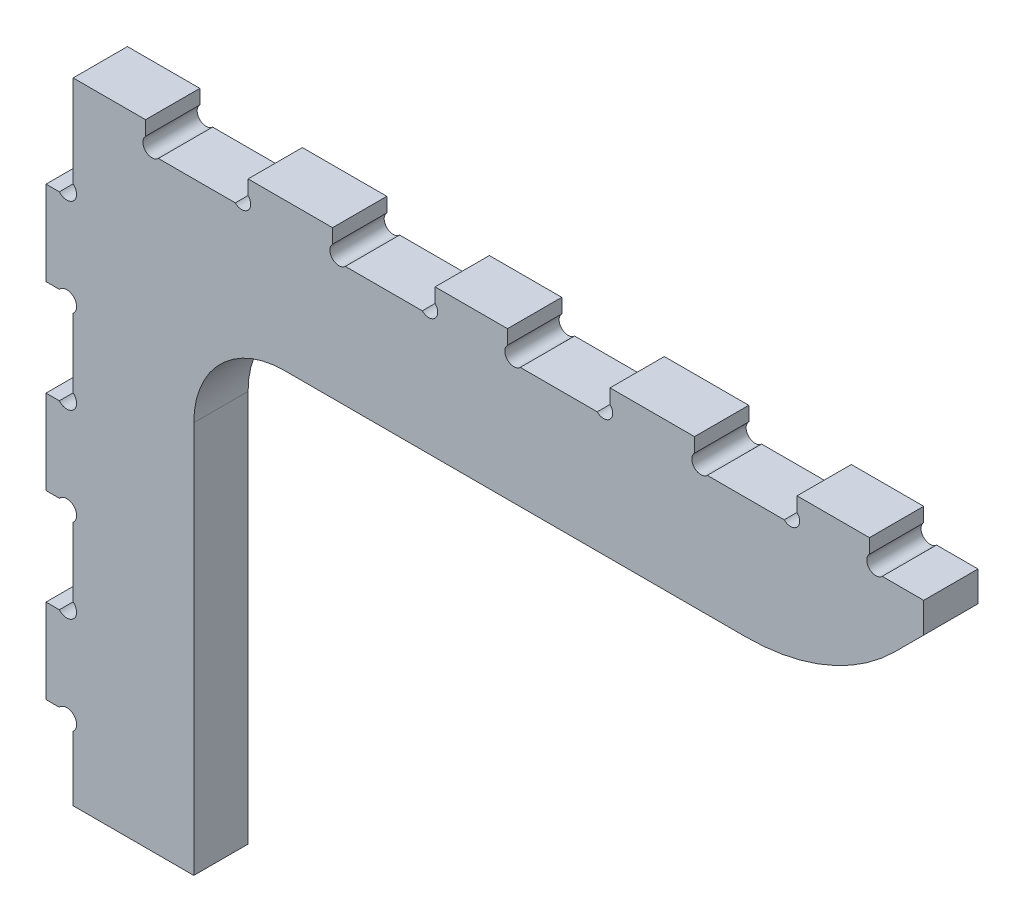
ISO-10303-21;
HEADER;
FILE_DESCRIPTION(('STEP AP214'),'2;1');
FILE_NAME('part.step','',(''),(''),'','','');
FILE_SCHEMA(('AUTOMOTIVE_DESIGN { 1 0 10303 214 1 1 1 1 }'));
ENDSEC;
DATA;
#1=APPLICATION_CONTEXT('core data for automotive mechanical design processes');
#2=APPLICATION_PROTOCOL_DEFINITION('international standard','automotive_design',2000,#1);
#3=PRODUCT_CONTEXT('',#1,'mechanical');
#4=PRODUCT('Part','Part','',(#3));
#5=PRODUCT_RELATED_PRODUCT_CATEGORY('part','',(#4));
#6=PRODUCT_DEFINITION_FORMATION('','',#4);
#7=PRODUCT_DEFINITION_CONTEXT('part definition',#1,'design');
#8=PRODUCT_DEFINITION('design','',#6,#7);
#9=PRODUCT_DEFINITION_SHAPE('','',#8);
#10=(LENGTH_UNIT() NAMED_UNIT(*) SI_UNIT(.MILLI.,.METRE.));
#11=(NAMED_UNIT(*) PLANE_ANGLE_UNIT() SI_UNIT($,.RADIAN.));
#12=(NAMED_UNIT(*) SI_UNIT($,.STERADIAN.) SOLID_ANGLE_UNIT());
#13=UNCERTAINTY_MEASURE_WITH_UNIT(LENGTH_MEASURE(1.E-05),#10,'distance_accuracy_value','');
#14=(GEOMETRIC_REPRESENTATION_CONTEXT(3) GLOBAL_UNCERTAINTY_ASSIGNED_CONTEXT((#13)) GLOBAL_UNIT_ASSIGNED_CONTEXT((#10,
#11,#12)) REPRESENTATION_CONTEXT('',''));
#15=CARTESIAN_POINT('',(0.,0.,0.));
#16=DIRECTION('',(0.,0.,1.));
#17=DIRECTION('',(1.,0.,0.));
#18=AXIS2_PLACEMENT_3D('',#15,#16,#17);
#19=CARTESIAN_POINT('',(28.2426406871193,200.,18.));
#20=DIRECTION('',(0.,-1.,0.));
#21=DIRECTION('',(0.,0.,-1.));
#22=AXIS2_PLACEMENT_3D('',#19,#20,#21);
#23=PLANE('',#22);
#24=DIRECTION('',(-1.,0.,0.));
#25=VECTOR('',#24,1.);
#26=CARTESIAN_POINT('',(28.2426406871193,200.,0.));
#27=LINE('',#26,#25);
#28=CARTESIAN_POINT('',(235.757359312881,200.,0.));
#29=VERTEX_POINT('',#28);
#30=CARTESIAN_POINT('',(210.242640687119,200.,0.));
#31=VERTEX_POINT('',#30);
#32=EDGE_CURVE('E567',#29,#31,#27,.T.);
#33=ORIENTED_EDGE('',*,*,#32,.T.);
#34=DIRECTION('',(0.,0.,1.));
#35=VECTOR('',#34,1.);
#36=CARTESIAN_POINT('',(210.242640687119,200.,0.));
#37=LINE('',#36,#35);
#38=CARTESIAN_POINT('',(210.242640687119,200.,18.));
#39=VERTEX_POINT('',#38);
#40=EDGE_CURVE('E749',#31,#39,#37,.T.);
#41=ORIENTED_EDGE('',*,*,#40,.T.);
#42=DIRECTION('',(-1.,0.,0.));
#43=VECTOR('',#42,1.);
#44=CARTESIAN_POINT('',(28.2426406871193,200.,18.));
#45=LINE('',#44,#43);
#46=CARTESIAN_POINT('',(235.757359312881,200.,18.));
#47=VERTEX_POINT('',#46);
#48=EDGE_CURVE('E505',#47,#39,#45,.T.);
#49=ORIENTED_EDGE('',*,*,#48,.F.);
#50=DIRECTION('',(0.,0.,1.));
#51=VECTOR('',#50,1.);
#52=CARTESIAN_POINT('',(235.757359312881,200.,0.));
#53=LINE('',#52,#51);
#54=EDGE_CURVE('E757',#47,#29,#53,.F.);
#55=ORIENTED_EDGE('',*,*,#54,.T.);
#56=EDGE_LOOP('',(#33,#41,#49,#55));
#57=FACE_BOUND('',#56,.T.);
#58=ADVANCED_FACE('F35',(#57),#23,.F.);
#59=CARTESIAN_POINT('',(282.,200.,0.));
#60=VERTEX_POINT('',#59);
#61=CARTESIAN_POINT('',(268.242640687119,200.,0.));
#62=VERTEX_POINT('',#61);
#63=EDGE_CURVE('E563',#60,#62,#27,.T.);
#64=ORIENTED_EDGE('',*,*,#63,.T.);
#65=DIRECTION('',(0.,0.,1.));
#66=VECTOR('',#65,1.);
#67=CARTESIAN_POINT('',(268.242640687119,200.,0.));
#68=LINE('',#67,#66);
#69=CARTESIAN_POINT('',(268.242640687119,200.,18.));
#70=VERTEX_POINT('',#69);
#71=EDGE_CURVE('E747',#62,#70,#68,.T.);
#72=ORIENTED_EDGE('',*,*,#71,.T.);
#73=CARTESIAN_POINT('',(282.,200.,18.));
#74=VERTEX_POINT('',#73);
#75=EDGE_CURVE('E384',#74,#70,#45,.T.);
#76=ORIENTED_EDGE('',*,*,#75,.F.);
#77=DIRECTION('',(0.,0.,-1.));
#78=VECTOR('',#77,1.);
#79=CARTESIAN_POINT('',(282.,200.,18.));
#80=LINE('',#79,#78);
#81=EDGE_CURVE('E679',#74,#60,#80,.T.);
#82=ORIENTED_EDGE('',*,*,#81,.T.);
#83=EDGE_LOOP('',(#64,#72,#76,#82));
#84=FACE_BOUND('',#83,.T.);
#85=ADVANCED_FACE('F955',(#84),#23,.F.);
#86=CARTESIAN_POINT('',(173.757359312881,200.,0.));
#87=VERTEX_POINT('',#86);
#88=CARTESIAN_POINT('',(148.242640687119,200.,0.));
#89=VERTEX_POINT('',#88);
#90=EDGE_CURVE('E809',#87,#89,#27,.T.);
#91=ORIENTED_EDGE('',*,*,#90,.T.);
#92=DIRECTION('',(0.,0.,1.));
#93=VECTOR('',#92,1.);
#94=CARTESIAN_POINT('',(148.242640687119,200.,0.));
#95=LINE('',#94,#93);
#96=CARTESIAN_POINT('',(148.242640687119,200.,18.));
#97=VERTEX_POINT('',#96);
#98=EDGE_CURVE('E751',#89,#97,#95,.T.);
#99=ORIENTED_EDGE('',*,*,#98,.T.);
#100=CARTESIAN_POINT('',(173.757359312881,200.,18.));
#101=VERTEX_POINT('',#100);
#102=EDGE_CURVE('E793',#101,#97,#45,.T.);
#103=ORIENTED_EDGE('',*,*,#102,.F.);
#104=DIRECTION('',(0.,0.,1.));
#105=VECTOR('',#104,1.);
#106=CARTESIAN_POINT('',(173.757359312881,200.,0.));
#107=LINE('',#106,#105);
#108=EDGE_CURVE('E769',#101,#87,#107,.F.);
#109=ORIENTED_EDGE('',*,*,#108,.T.);
#110=EDGE_LOOP('',(#91,#99,#103,#109));
#111=FACE_BOUND('',#110,.T.);
#112=ADVANCED_FACE('F957',(#111),#23,.F.);
#113=CARTESIAN_POINT('',(115.757359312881,200.,18.));
#114=VERTEX_POINT('',#113);
#115=CARTESIAN_POINT('',(90.2426406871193,200.,18.));
#116=VERTEX_POINT('',#115);
#117=EDGE_CURVE('E506',#114,#116,#45,.T.);
#118=ORIENTED_EDGE('',*,*,#117,.F.);
#119=DIRECTION('',(0.,0.,1.));
#120=VECTOR('',#119,1.);
#121=CARTESIAN_POINT('',(115.757359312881,200.,0.));
#122=LINE('',#121,#120);
#123=CARTESIAN_POINT('',(115.757359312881,200.,0.));
#124=VERTEX_POINT('',#123);
#125=EDGE_CURVE('E772',#114,#124,#122,.F.);
#126=ORIENTED_EDGE('',*,*,#125,.T.);
#127=CARTESIAN_POINT('',(90.2426406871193,200.,0.));
#128=VERTEX_POINT('',#127);
#129=EDGE_CURVE('E808',#124,#128,#27,.T.);
#130=ORIENTED_EDGE('',*,*,#129,.T.);
#131=DIRECTION('',(0.,0.,1.));
#132=VECTOR('',#131,1.);
#133=CARTESIAN_POINT('',(90.2426406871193,200.,0.));
#134=LINE('',#133,#132);
#135=EDGE_CURVE('E455',#128,#116,#134,.T.);
#136=ORIENTED_EDGE('',*,*,#135,.T.);
#137=EDGE_LOOP('',(#118,#126,#130,#136));
#138=FACE_BOUND('',#137,.T.);
#139=ADVANCED_FACE('F806',(#138),#23,.F.);
#140=CARTESIAN_POINT('',(53.7573593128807,200.,18.));
#141=VERTEX_POINT('',#140);
#142=CARTESIAN_POINT('',(28.2426406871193,200.,18.));
#143=VERTEX_POINT('',#142);
#144=EDGE_CURVE('E502',#141,#143,#45,.T.);
#145=ORIENTED_EDGE('',*,*,#144,.F.);
#146=DIRECTION('',(0.,0.,1.));
#147=VECTOR('',#146,1.);
#148=CARTESIAN_POINT('',(53.7573593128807,200.,0.));
#149=LINE('',#148,#147);
#150=CARTESIAN_POINT('',(53.7573593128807,200.,0.));
#151=VERTEX_POINT('',#150);
#152=EDGE_CURVE('E463',#141,#151,#149,.F.);
#153=ORIENTED_EDGE('',*,*,#152,.T.);
#154=CARTESIAN_POINT('',(28.2426406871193,200.,0.));
#155=VERTEX_POINT('',#154);
#156=EDGE_CURVE('E562',#151,#155,#27,.T.);
#157=ORIENTED_EDGE('',*,*,#156,.T.);
#158=DIRECTION('',(0.,0.,-1.));
#159=VECTOR('',#158,1.);
#160=CARTESIAN_POINT('',(28.2426406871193,200.,18.));
#161=LINE('',#160,#159);
#162=EDGE_CURVE('E676',#143,#155,#161,.T.);
#163=ORIENTED_EDGE('',*,*,#162,.F.);
#164=EDGE_LOOP('',(#145,#153,#157,#163));
#165=FACE_BOUND('',#164,.T.);
#166=ADVANCED_FACE('F813',(#165),#23,.F.);
#167=CARTESIAN_POINT('',(40.,0.,18.));
#168=DIRECTION('',(0.,1.,0.));
#169=DIRECTION('',(-1.,0.,0.));
#170=AXIS2_PLACEMENT_3D('',#167,#168,#169);
#171=PLANE('',#170);
#172=DIRECTION('',(1.,0.,0.));
#173=VECTOR('',#172,1.);
#174=CARTESIAN_POINT('',(40.,0.,0.));
#175=LINE('',#174,#173);
#176=CARTESIAN_POINT('',(0.,0.,0.));
#177=VERTEX_POINT('',#176);
#178=CARTESIAN_POINT('',(40.,0.,0.));
#179=VERTEX_POINT('',#178);
#180=EDGE_CURVE('E488',#177,#179,#175,.T.);
#181=ORIENTED_EDGE('',*,*,#180,.T.);
#182=DIRECTION('',(0.,0.,-1.));
#183=VECTOR('',#182,1.);
#184=CARTESIAN_POINT('',(40.,0.,18.));
#185=LINE('',#184,#183);
#186=CARTESIAN_POINT('',(40.,0.,18.));
#187=VERTEX_POINT('',#186);
#188=EDGE_CURVE('E688',#187,#179,#185,.T.);
#189=ORIENTED_EDGE('',*,*,#188,.F.);
#190=DIRECTION('',(1.,0.,0.));
#191=VECTOR('',#190,1.);
#192=CARTESIAN_POINT('',(40.,0.,18.));
#193=LINE('',#192,#191);
#194=CARTESIAN_POINT('',(0.,0.,18.));
#195=VERTEX_POINT('',#194);
#196=EDGE_CURVE('E489',#195,#187,#193,.T.);
#197=ORIENTED_EDGE('',*,*,#196,.F.);
#198=DIRECTION('',(0.,0.,-1.));
#199=VECTOR('',#198,1.);
#200=CARTESIAN_POINT('',(0.,0.,18.));
#201=LINE('',#200,#199);
#202=EDGE_CURVE('E550',#195,#177,#201,.T.);
#203=ORIENTED_EDGE('',*,*,#202,.T.);
#204=EDGE_LOOP('',(#181,#189,#197,#203));
#205=FACE_BOUND('',#204,.T.);
#206=ADVANCED_FACE('F927',(#205),#171,.F.);
#207=CARTESIAN_POINT('',(40.,130.,18.));
#208=DIRECTION('',(-1.,0.,0.));
#209=DIRECTION('',(0.,-1.,0.));
#210=AXIS2_PLACEMENT_3D('',#207,#208,#209);
#211=PLANE('',#210);
#212=DIRECTION('',(0.,1.,0.));
#213=VECTOR('',#212,1.);
#214=CARTESIAN_POINT('',(40.,130.,0.));
#215=LINE('',#214,#213);
#216=CARTESIAN_POINT('',(40.,130.,0.));
#217=VERTEX_POINT('',#216);
#218=EDGE_CURVE('E553',#179,#217,#215,.T.);
#219=ORIENTED_EDGE('',*,*,#218,.T.);
#220=DIRECTION('',(0.,0.,-1.));
#221=VECTOR('',#220,1.);
#222=CARTESIAN_POINT('',(40.,130.,18.));
#223=LINE('',#222,#221);
#224=CARTESIAN_POINT('',(40.,130.,18.));
#225=VERTEX_POINT('',#224);
#226=EDGE_CURVE('E685',#225,#217,#223,.T.);
#227=ORIENTED_EDGE('',*,*,#226,.F.);
#228=DIRECTION('',(0.,1.,0.));
#229=VECTOR('',#228,1.);
#230=CARTESIAN_POINT('',(40.,130.,18.));
#231=LINE('',#230,#229);
#232=EDGE_CURVE('E492',#187,#225,#231,.T.);
#233=ORIENTED_EDGE('',*,*,#232,.F.);
#234=ORIENTED_EDGE('',*,*,#188,.T.);
#235=EDGE_LOOP('',(#219,#227,#233,#234));
#236=FACE_BOUND('',#235,.T.);
#237=ADVANCED_FACE('F929',(#236),#211,.F.);
#238=CARTESIAN_POINT('',(70.,130.,18.));
#239=DIRECTION('',(0.,0.,-1.));
#240=DIRECTION('',(-1.,0.,0.));
#241=AXIS2_PLACEMENT_3D('',#238,#239,#240);
#242=CYLINDRICAL_SURFACE('',#241,30.);
#243=CARTESIAN_POINT('',(70.,130.,0.));
#244=DIRECTION('',(0.,0.,-1.));
#245=DIRECTION('',(1.,0.,0.));
#246=AXIS2_PLACEMENT_3D('',#243,#244,#245);
#247=CIRCLE('',#246,30.);
#248=CARTESIAN_POINT('',(70.,160.,0.));
#249=VERTEX_POINT('',#248);
#250=EDGE_CURVE('E555',#217,#249,#247,.T.);
#251=ORIENTED_EDGE('',*,*,#250,.T.);
#252=DIRECTION('',(0.,0.,-1.));
#253=VECTOR('',#252,1.);
#254=CARTESIAN_POINT('',(70.,160.,18.));
#255=LINE('',#254,#253);
#256=CARTESIAN_POINT('',(70.,160.,18.));
#257=VERTEX_POINT('',#256);
#258=EDGE_CURVE('E682',#257,#249,#255,.T.);
#259=ORIENTED_EDGE('',*,*,#258,.F.);
#260=CARTESIAN_POINT('',(70.,130.,18.));
#261=DIRECTION('',(0.,0.,-1.));
#262=DIRECTION('',(1.,0.,0.));
#263=AXIS2_PLACEMENT_3D('',#260,#261,#262);
#264=CIRCLE('',#263,30.);
#265=EDGE_CURVE('E495',#225,#257,#264,.T.);
#266=ORIENTED_EDGE('',*,*,#265,.F.);
#267=ORIENTED_EDGE('',*,*,#226,.T.);
#268=EDGE_LOOP('',(#251,#259,#266,#267));
#269=FACE_BOUND('',#268,.T.);
#270=ADVANCED_FACE('F935',(#269),#242,.F.);
#271=CARTESIAN_POINT('',(282.,160.,18.));
#272=DIRECTION('',(0.,1.,0.));
#273=DIRECTION('',(-1.,0.,0.));
#274=AXIS2_PLACEMENT_3D('',#271,#272,#273);
#275=PLANE('',#274);
#276=DIRECTION('',(1.,0.,0.));
#277=VECTOR('',#276,1.);
#278=CARTESIAN_POINT('',(282.,160.,0.));
#279=LINE('',#278,#277);
#280=CARTESIAN_POINT('',(223.005050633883,160.,0.));
#281=VERTEX_POINT('',#280);
#282=EDGE_CURVE('E557',#249,#281,#279,.T.);
#283=ORIENTED_EDGE('',*,*,#282,.T.);
#284=DIRECTION('',(0.,0.,-1.));
#285=VECTOR('',#284,1.);
#286=CARTESIAN_POINT('',(223.005050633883,160.,18.));
#287=LINE('',#286,#285);
#288=CARTESIAN_POINT('',(223.005050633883,160.,18.));
#289=VERTEX_POINT('',#288);
#290=EDGE_CURVE('E699',#281,#289,#287,.F.);
#291=ORIENTED_EDGE('',*,*,#290,.T.);
#292=DIRECTION('',(1.,0.,0.));
#293=VECTOR('',#292,1.);
#294=CARTESIAN_POINT('',(282.,160.,18.));
#295=LINE('',#294,#293);
#296=EDGE_CURVE('E497',#257,#289,#295,.T.);
#297=ORIENTED_EDGE('',*,*,#296,.F.);
#298=ORIENTED_EDGE('',*,*,#258,.T.);
#299=EDGE_LOOP('',(#283,#291,#297,#298));
#300=FACE_BOUND('',#299,.T.);
#301=ADVANCED_FACE('F939',(#300),#275,.F.);
#302=CARTESIAN_POINT('',(282.,200.,18.));
#303=DIRECTION('',(-1.,0.,0.));
#304=DIRECTION('',(0.,0.,1.));
#305=AXIS2_PLACEMENT_3D('',#302,#303,#304);
#306=PLANE('',#305);
#307=DIRECTION('',(0.,1.,0.));
#308=VECTOR('',#307,1.);
#309=CARTESIAN_POINT('',(282.,200.,18.));
#310=LINE('',#309,#308);
#311=CARTESIAN_POINT('',(282.,190.,18.));
#312=VERTEX_POINT('',#311);
#313=EDGE_CURVE('E500',#312,#74,#310,.T.);
#314=ORIENTED_EDGE('',*,*,#313,.F.);
#315=DIRECTION('',(0.,0.,-1.));
#316=VECTOR('',#315,1.);
#317=CARTESIAN_POINT('',(282.,190.,18.));
#318=LINE('',#317,#316);
#319=CARTESIAN_POINT('',(282.,190.,0.));
#320=VERTEX_POINT('',#319);
#321=EDGE_CURVE('E691',#312,#320,#318,.T.);
#322=ORIENTED_EDGE('',*,*,#321,.T.);
#323=DIRECTION('',(0.,1.,0.));
#324=VECTOR('',#323,1.);
#325=CARTESIAN_POINT('',(282.,200.,0.));
#326=LINE('',#325,#324);
#327=EDGE_CURVE('E560',#320,#60,#326,.T.);
#328=ORIENTED_EDGE('',*,*,#327,.T.);
#329=ORIENTED_EDGE('',*,*,#81,.F.);
#330=EDGE_LOOP('',(#314,#322,#328,#329));
#331=FACE_BOUND('',#330,.T.);
#332=ADVANCED_FACE('F951',(#331),#306,.F.);
#333=CARTESIAN_POINT('',(26.1213203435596,202.12132034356,18.));
#334=DIRECTION('',(0.,0.,-1.));
#335=DIRECTION('',(-1.,0.,0.));
#336=AXIS2_PLACEMENT_3D('',#333,#334,#335);
#337=CYLINDRICAL_SURFACE('',#336,3.);
#338=CARTESIAN_POINT('',(26.1213203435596,202.12132034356,0.));
#339=DIRECTION('',(0.,0.,-1.));
#340=DIRECTION('',(1.,0.,0.));
#341=AXIS2_PLACEMENT_3D('',#338,#339,#340);
#342=CIRCLE('',#341,3.);
#343=CARTESIAN_POINT('',(24.,204.242640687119,0.));
#344=VERTEX_POINT('',#343);
#345=EDGE_CURVE('E566',#155,#344,#342,.T.);
#346=ORIENTED_EDGE('',*,*,#345,.T.);
#347=DIRECTION('',(0.,0.,-1.));
#348=VECTOR('',#347,1.);
#349=CARTESIAN_POINT('',(24.,204.242640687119,18.));
#350=LINE('',#349,#348);
#351=CARTESIAN_POINT('',(24.,204.242640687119,18.));
#352=VERTEX_POINT('',#351);
#353=EDGE_CURVE('E673',#352,#344,#350,.T.);
#354=ORIENTED_EDGE('',*,*,#353,.F.);
#355=CARTESIAN_POINT('',(26.1213203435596,202.12132034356,18.));
#356=DIRECTION('',(0.,0.,-1.));
#357=DIRECTION('',(1.,0.,0.));
#358=AXIS2_PLACEMENT_3D('',#355,#356,#357);
#359=CIRCLE('',#358,3.);
#360=EDGE_CURVE('E504',#143,#352,#359,.T.);
#361=ORIENTED_EDGE('',*,*,#360,.F.);
#362=ORIENTED_EDGE('',*,*,#162,.T.);
#363=EDGE_LOOP('',(#346,#354,#361,#362));
#364=FACE_BOUND('',#363,.T.);
#365=ADVANCED_FACE('F817',(#364),#337,.F.);
#366=CARTESIAN_POINT('',(24.,209.,18.));
#367=DIRECTION('',(-1.,0.,0.));
#368=DIRECTION('',(0.,-1.,0.));
#369=AXIS2_PLACEMENT_3D('',#366,#367,#368);
#370=PLANE('',#369);
#371=DIRECTION('',(0.,1.,0.));
#372=VECTOR('',#371,1.);
#373=CARTESIAN_POINT('',(24.,209.,0.));
#374=LINE('',#373,#372);
#375=CARTESIAN_POINT('',(24.,209.,0.));
#376=VERTEX_POINT('',#375);
#377=EDGE_CURVE('E569',#344,#376,#374,.T.);
#378=ORIENTED_EDGE('',*,*,#377,.T.);
#379=DIRECTION('',(0.,0.,-1.));
#380=VECTOR('',#379,1.);
#381=CARTESIAN_POINT('',(24.,209.,18.));
#382=LINE('',#381,#380);
#383=CARTESIAN_POINT('',(24.,209.,18.));
#384=VERTEX_POINT('',#383);
#385=EDGE_CURVE('E670',#384,#376,#382,.T.);
#386=ORIENTED_EDGE('',*,*,#385,.F.);
#387=DIRECTION('',(0.,1.,0.));
#388=VECTOR('',#387,1.);
#389=CARTESIAN_POINT('',(24.,209.,18.));
#390=LINE('',#389,#388);
#391=EDGE_CURVE('E508',#352,#384,#390,.T.);
#392=ORIENTED_EDGE('',*,*,#391,.F.);
#393=ORIENTED_EDGE('',*,*,#353,.T.);
#394=EDGE_LOOP('',(#378,#386,#392,#393));
#395=FACE_BOUND('',#394,.T.);
#396=ADVANCED_FACE('F823',(#395),#370,.F.);
#397=CARTESIAN_POINT('',(0.,209.,18.));
#398=DIRECTION('',(0.,-1.,0.));
#399=DIRECTION('',(0.,0.,-1.));
#400=AXIS2_PLACEMENT_3D('',#397,#398,#399);
#401=PLANE('',#400);
#402=DIRECTION('',(-1.,0.,0.));
#403=VECTOR('',#402,1.);
#404=CARTESIAN_POINT('',(0.,209.,0.));
#405=LINE('',#404,#403);
#406=CARTESIAN_POINT('',(0.,209.,0.));
#407=VERTEX_POINT('',#406);
#408=EDGE_CURVE('E571',#376,#407,#405,.T.);
#409=ORIENTED_EDGE('',*,*,#408,.T.);
#410=DIRECTION('',(0.,0.,-1.));
#411=VECTOR('',#410,1.);
#412=CARTESIAN_POINT('',(0.,209.,18.));
#413=LINE('',#412,#411);
#414=CARTESIAN_POINT('',(0.,209.,18.));
#415=VERTEX_POINT('',#414);
#416=EDGE_CURVE('E667',#415,#407,#413,.T.);
#417=ORIENTED_EDGE('',*,*,#416,.F.);
#418=DIRECTION('',(-1.,0.,0.));
#419=VECTOR('',#418,1.);
#420=CARTESIAN_POINT('',(0.,209.,18.));
#421=LINE('',#420,#419);
#422=EDGE_CURVE('E510',#384,#415,#421,.T.);
#423=ORIENTED_EDGE('',*,*,#422,.F.);
#424=ORIENTED_EDGE('',*,*,#385,.T.);
#425=EDGE_LOOP('',(#409,#417,#423,#424));
#426=FACE_BOUND('',#425,.T.);
#427=ADVANCED_FACE('F827',(#426),#401,.F.);
#428=CARTESIAN_POINT('',(-4.18977760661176E-13,178.581922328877,18.));
#429=DIRECTION('',(1.,0.,0.));
#430=DIRECTION('',(0.,1.,0.));
#431=AXIS2_PLACEMENT_3D('',#428,#429,#430);
#432=PLANE('',#431);
#433=DIRECTION('',(0.,-1.,0.));
#434=VECTOR('',#433,1.);
#435=CARTESIAN_POINT('',(-4.18977760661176E-13,178.581922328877,0.));
#436=LINE('',#435,#434);
#437=CARTESIAN_POINT('',(0.,178.581922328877,0.));
#438=VERTEX_POINT('',#437);
#439=EDGE_CURVE('E574',#407,#438,#436,.T.);
#440=ORIENTED_EDGE('',*,*,#439,.T.);
#441=DIRECTION('',(0.,0.,-1.));
#442=VECTOR('',#441,1.);
#443=CARTESIAN_POINT('',(0.,178.581922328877,18.));
#444=LINE('',#443,#442);
#445=CARTESIAN_POINT('',(0.,178.581922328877,18.));
#446=VERTEX_POINT('',#445);
#447=EDGE_CURVE('E664',#446,#438,#444,.T.);
#448=ORIENTED_EDGE('',*,*,#447,.F.);
#449=DIRECTION('',(0.,-1.,0.));
#450=VECTOR('',#449,1.);
#451=CARTESIAN_POINT('',(0.,200.,18.));
#452=LINE('',#451,#450);
#453=EDGE_CURVE('E512',#415,#446,#452,.T.);
#454=ORIENTED_EDGE('',*,*,#453,.F.);
#455=ORIENTED_EDGE('',*,*,#416,.T.);
#456=EDGE_LOOP('',(#440,#448,#454,#455));
#457=FACE_BOUND('',#456,.T.);
#458=ADVANCED_FACE('F834',(#457),#432,.F.);
#459=CARTESIAN_POINT('',(-2.11000000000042,176.11,18.));
#460=DIRECTION('',(0.,0.,-1.));
#461=DIRECTION('',(-1.,0.,0.));
#462=AXIS2_PLACEMENT_3D('',#459,#460,#461);
#463=CYLINDRICAL_SURFACE('',#462,3.25000000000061);
#464=CARTESIAN_POINT('',(-2.11000000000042,176.11,0.));
#465=DIRECTION('',(0.,0.,-1.));
#466=DIRECTION('',(1.,0.,0.));
#467=AXIS2_PLACEMENT_3D('',#464,#465,#466);
#468=CIRCLE('',#467,3.25000000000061);
#469=CARTESIAN_POINT('',(-4.58192232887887,174.,0.));
#470=VERTEX_POINT('',#469);
#471=EDGE_CURVE('E576',#438,#470,#468,.T.);
#472=ORIENTED_EDGE('',*,*,#471,.T.);
#473=DIRECTION('',(0.,0.,-1.));
#474=VECTOR('',#473,1.);
#475=CARTESIAN_POINT('',(-4.58192232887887,174.,18.));
#476=LINE('',#475,#474);
#477=CARTESIAN_POINT('',(-4.58192232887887,174.,18.));
#478=VERTEX_POINT('',#477);
#479=EDGE_CURVE('E661',#478,#470,#476,.T.);
#480=ORIENTED_EDGE('',*,*,#479,.F.);
#481=CARTESIAN_POINT('',(-2.11000000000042,176.11,18.));
#482=DIRECTION('',(0.,0.,-1.));
#483=DIRECTION('',(1.,0.,0.));
#484=AXIS2_PLACEMENT_3D('',#481,#482,#483);
#485=CIRCLE('',#484,3.25000000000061);
#486=EDGE_CURVE('E514',#446,#478,#485,.T.);
#487=ORIENTED_EDGE('',*,*,#486,.F.);
#488=ORIENTED_EDGE('',*,*,#447,.T.);
#489=EDGE_LOOP('',(#472,#480,#487,#488));
#490=FACE_BOUND('',#489,.T.);
#491=ADVANCED_FACE('F837',(#490),#463,.F.);
#492=CARTESIAN_POINT('',(-4.58192232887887,174.,18.));
#493=DIRECTION('',(0.,-1.,0.));
#494=DIRECTION('',(1.,0.,0.));
#495=AXIS2_PLACEMENT_3D('',#492,#493,#494);
#496=PLANE('',#495);
#497=DIRECTION('',(-1.,0.,0.));
#498=VECTOR('',#497,1.);
#499=CARTESIAN_POINT('',(-4.58192232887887,174.,0.));
#500=LINE('',#499,#498);
#501=CARTESIAN_POINT('',(-9.00000000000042,174.,0.));
#502=VERTEX_POINT('',#501);
#503=EDGE_CURVE('E578',#470,#502,#500,.T.);
#504=ORIENTED_EDGE('',*,*,#503,.T.);
#505=DIRECTION('',(0.,0.,-1.));
#506=VECTOR('',#505,1.);
#507=CARTESIAN_POINT('',(-9.00000000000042,174.,18.));
#508=LINE('',#507,#506);
#509=CARTESIAN_POINT('',(-9.00000000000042,174.,18.));
#510=VERTEX_POINT('',#509);
#511=EDGE_CURVE('E658',#510,#502,#508,.T.);
#512=ORIENTED_EDGE('',*,*,#511,.F.);
#513=DIRECTION('',(-1.,0.,0.));
#514=VECTOR('',#513,1.);
#515=CARTESIAN_POINT('',(-4.58192232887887,174.,18.));
#516=LINE('',#515,#514);
#517=EDGE_CURVE('E516',#478,#510,#516,.T.);
#518=ORIENTED_EDGE('',*,*,#517,.F.);
#519=ORIENTED_EDGE('',*,*,#479,.T.);
#520=EDGE_LOOP('',(#504,#512,#518,#519));
#521=FACE_BOUND('',#520,.T.);
#522=ADVANCED_FACE('F842',(#521),#496,.F.);
#523=CARTESIAN_POINT('',(-9.00000000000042,146.,18.));
#524=DIRECTION('',(1.,0.,0.));
#525=DIRECTION('',(0.,1.,0.));
#526=AXIS2_PLACEMENT_3D('',#523,#524,#525);
#527=PLANE('',#526);
#528=DIRECTION('',(0.,-1.,0.));
#529=VECTOR('',#528,1.);
#530=CARTESIAN_POINT('',(-9.00000000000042,146.,0.));
#531=LINE('',#530,#529);
#532=CARTESIAN_POINT('',(-9.00000000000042,146.,0.));
#533=VERTEX_POINT('',#532);
#534=EDGE_CURVE('E580',#502,#533,#531,.T.);
#535=ORIENTED_EDGE('',*,*,#534,.T.);
#536=DIRECTION('',(0.,0.,-1.));
#537=VECTOR('',#536,1.);
#538=CARTESIAN_POINT('',(-9.00000000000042,146.,18.));
#539=LINE('',#538,#537);
#540=CARTESIAN_POINT('',(-9.00000000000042,146.,18.));
#541=VERTEX_POINT('',#540);
#542=EDGE_CURVE('E655',#541,#533,#539,.T.);
#543=ORIENTED_EDGE('',*,*,#542,.F.);
#544=DIRECTION('',(0.,-1.,0.));
#545=VECTOR('',#544,1.);
#546=CARTESIAN_POINT('',(-9.00000000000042,146.,18.));
#547=LINE('',#546,#545);
#548=EDGE_CURVE('E518',#510,#541,#547,.T.);
#549=ORIENTED_EDGE('',*,*,#548,.F.);
#550=ORIENTED_EDGE('',*,*,#511,.T.);
#551=EDGE_LOOP('',(#535,#543,#549,#550));
#552=FACE_BOUND('',#551,.T.);
#553=ADVANCED_FACE('F848',(#552),#527,.F.);
#554=CARTESIAN_POINT('',(-4.58192232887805,146.,18.));
#555=DIRECTION('',(0.,1.,0.));
#556=DIRECTION('',(-1.,0.,0.));
#557=AXIS2_PLACEMENT_3D('',#554,#555,#556);
#558=PLANE('',#557);
#559=DIRECTION('',(1.,0.,0.));
#560=VECTOR('',#559,1.);
#561=CARTESIAN_POINT('',(-4.58192232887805,146.,0.));
#562=LINE('',#561,#560);
#563=CARTESIAN_POINT('',(-4.58192232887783,146.,0.));
#564=VERTEX_POINT('',#563);
#565=EDGE_CURVE('E582',#533,#564,#562,.T.);
#566=ORIENTED_EDGE('',*,*,#565,.T.);
#567=DIRECTION('',(0.,0.,-1.));
#568=VECTOR('',#567,1.);
#569=CARTESIAN_POINT('',(-4.58192232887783,146.,18.));
#570=LINE('',#569,#568);
#571=CARTESIAN_POINT('',(-4.58192232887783,146.,18.));
#572=VERTEX_POINT('',#571);
#573=EDGE_CURVE('E652',#572,#564,#570,.T.);
#574=ORIENTED_EDGE('',*,*,#573,.F.);
#575=DIRECTION('',(1.,0.,0.));
#576=VECTOR('',#575,1.);
#577=CARTESIAN_POINT('',(-4.58192232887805,146.,18.));
#578=LINE('',#577,#576);
#579=EDGE_CURVE('E520',#541,#572,#578,.T.);
#580=ORIENTED_EDGE('',*,*,#579,.F.);
#581=ORIENTED_EDGE('',*,*,#542,.T.);
#582=EDGE_LOOP('',(#566,#574,#580,#581));
#583=FACE_BOUND('',#582,.T.);
#584=ADVANCED_FACE('F852',(#583),#558,.F.);
#585=CARTESIAN_POINT('',(-2.11000000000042,143.89,18.));
#586=DIRECTION('',(0.,0.,-1.));
#587=DIRECTION('',(-1.,0.,0.));
#588=AXIS2_PLACEMENT_3D('',#585,#586,#587);
#589=CYLINDRICAL_SURFACE('',#588,3.25000000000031);
#590=CARTESIAN_POINT('',(-2.11000000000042,143.89,0.));
#591=DIRECTION('',(0.,0.,-1.));
#592=DIRECTION('',(1.,0.,0.));
#593=AXIS2_PLACEMENT_3D('',#590,#591,#592);
#594=CIRCLE('',#593,3.25000000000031);
#595=CARTESIAN_POINT('',(-2.09488880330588E-13,141.418077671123,0.));
#596=VERTEX_POINT('',#595);
#597=EDGE_CURVE('E584',#564,#596,#594,.T.);
#598=ORIENTED_EDGE('',*,*,#597,.T.);
#599=DIRECTION('',(0.,0.,-1.));
#600=VECTOR('',#599,1.);
#601=CARTESIAN_POINT('',(-2.09488880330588E-13,141.418077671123,18.));
#602=LINE('',#601,#600);
#603=CARTESIAN_POINT('',(-2.09488880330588E-13,141.418077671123,18.));
#604=VERTEX_POINT('',#603);
#605=EDGE_CURVE('E649',#604,#596,#602,.T.);
#606=ORIENTED_EDGE('',*,*,#605,.F.);
#607=CARTESIAN_POINT('',(-2.11000000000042,143.89,18.));
#608=DIRECTION('',(0.,0.,-1.));
#609=DIRECTION('',(1.,0.,0.));
#610=AXIS2_PLACEMENT_3D('',#607,#608,#609);
#611=CIRCLE('',#610,3.25000000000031);
#612=EDGE_CURVE('E522',#572,#604,#611,.T.);
#613=ORIENTED_EDGE('',*,*,#612,.F.);
#614=ORIENTED_EDGE('',*,*,#573,.T.);
#615=EDGE_LOOP('',(#598,#606,#613,#614));
#616=FACE_BOUND('',#615,.T.);
#617=ADVANCED_FACE('F857',(#616),#589,.F.);
#618=CARTESIAN_POINT('',(-2.09488880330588E-13,118.581922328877,18.));
#619=DIRECTION('',(1.,0.,0.));
#620=DIRECTION('',(0.,1.,0.));
#621=AXIS2_PLACEMENT_3D('',#618,#619,#620);
#622=PLANE('',#621);
#623=DIRECTION('',(0.,-1.,0.));
#624=VECTOR('',#623,1.);
#625=CARTESIAN_POINT('',(-2.09488880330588E-13,118.581922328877,0.));
#626=LINE('',#625,#624);
#627=CARTESIAN_POINT('',(2.3635607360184E-13,118.581922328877,0.));
#628=VERTEX_POINT('',#627);
#629=EDGE_CURVE('E586',#596,#628,#626,.T.);
#630=ORIENTED_EDGE('',*,*,#629,.T.);
#631=DIRECTION('',(0.,0.,-1.));
#632=VECTOR('',#631,1.);
#633=CARTESIAN_POINT('',(2.3635607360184E-13,118.581922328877,18.));
#634=LINE('',#633,#632);
#635=CARTESIAN_POINT('',(2.3635607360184E-13,118.581922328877,18.));
#636=VERTEX_POINT('',#635);
#637=EDGE_CURVE('E646',#636,#628,#634,.T.);
#638=ORIENTED_EDGE('',*,*,#637,.F.);
#639=DIRECTION('',(0.,-1.,0.));
#640=VECTOR('',#639,1.);
#641=CARTESIAN_POINT('',(-2.09488880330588E-13,118.581922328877,18.));
#642=LINE('',#641,#640);
#643=EDGE_CURVE('E524',#604,#636,#642,.T.);
#644=ORIENTED_EDGE('',*,*,#643,.F.);
#645=ORIENTED_EDGE('',*,*,#605,.T.);
#646=EDGE_LOOP('',(#630,#638,#644,#645));
#647=FACE_BOUND('',#646,.T.);
#648=ADVANCED_FACE('F863',(#647),#622,.F.);
#649=CARTESIAN_POINT('',(-2.11000000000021,116.11,18.));
#650=DIRECTION('',(0.,0.,-1.));
#651=DIRECTION('',(-1.,0.,0.));
#652=AXIS2_PLACEMENT_3D('',#649,#650,#651);
#653=CYLINDRICAL_SURFACE('',#652,3.25000000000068);
#654=CARTESIAN_POINT('',(-2.11000000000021,116.11,0.));
#655=DIRECTION('',(0.,0.,-1.));
#656=DIRECTION('',(1.,0.,0.));
#657=AXIS2_PLACEMENT_3D('',#654,#655,#656);
#658=CIRCLE('',#657,3.25000000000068);
#659=CARTESIAN_POINT('',(-4.58192232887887,114.,0.));
#660=VERTEX_POINT('',#659);
#661=EDGE_CURVE('E588',#628,#660,#658,.T.);
#662=ORIENTED_EDGE('',*,*,#661,.T.);
#663=DIRECTION('',(0.,0.,-1.));
#664=VECTOR('',#663,1.);
#665=CARTESIAN_POINT('',(-4.58192232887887,114.,18.));
#666=LINE('',#665,#664);
#667=CARTESIAN_POINT('',(-4.58192232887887,114.,18.));
#668=VERTEX_POINT('',#667);
#669=EDGE_CURVE('E643',#668,#660,#666,.T.);
#670=ORIENTED_EDGE('',*,*,#669,.F.);
#671=CARTESIAN_POINT('',(-2.11000000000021,116.11,18.));
#672=DIRECTION('',(0.,0.,-1.));
#673=DIRECTION('',(1.,0.,0.));
#674=AXIS2_PLACEMENT_3D('',#671,#672,#673);
#675=CIRCLE('',#674,3.25000000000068);
#676=EDGE_CURVE('E526',#636,#668,#675,.T.);
#677=ORIENTED_EDGE('',*,*,#676,.F.);
#678=ORIENTED_EDGE('',*,*,#637,.T.);
#679=EDGE_LOOP('',(#662,#670,#677,#678));
#680=FACE_BOUND('',#679,.T.);
#681=ADVANCED_FACE('F867',(#680),#653,.F.);
#682=CARTESIAN_POINT('',(-4.58192232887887,114.,18.));
#683=DIRECTION('',(0.,-1.,0.));
#684=DIRECTION('',(1.,0.,0.));
#685=AXIS2_PLACEMENT_3D('',#682,#683,#684);
#686=PLANE('',#685);
#687=DIRECTION('',(-1.,0.,0.));
#688=VECTOR('',#687,1.);
#689=CARTESIAN_POINT('',(-4.58192232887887,114.,0.));
#690=LINE('',#689,#688);
#691=CARTESIAN_POINT('',(-9.00000000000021,114.,0.));
#692=VERTEX_POINT('',#691);
#693=EDGE_CURVE('E590',#660,#692,#690,.T.);
#694=ORIENTED_EDGE('',*,*,#693,.T.);
#695=DIRECTION('',(0.,0.,-1.));
#696=VECTOR('',#695,1.);
#697=CARTESIAN_POINT('',(-9.00000000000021,114.,18.));
#698=LINE('',#697,#696);
#699=CARTESIAN_POINT('',(-9.00000000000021,114.,18.));
#700=VERTEX_POINT('',#699);
#701=EDGE_CURVE('E640',#700,#692,#698,.T.);
#702=ORIENTED_EDGE('',*,*,#701,.F.);
#703=DIRECTION('',(-1.,0.,0.));
#704=VECTOR('',#703,1.);
#705=CARTESIAN_POINT('',(-4.58192232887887,114.,18.));
#706=LINE('',#705,#704);
#707=EDGE_CURVE('E528',#668,#700,#706,.T.);
#708=ORIENTED_EDGE('',*,*,#707,.F.);
#709=ORIENTED_EDGE('',*,*,#669,.T.);
#710=EDGE_LOOP('',(#694,#702,#708,#709));
#711=FACE_BOUND('',#710,.T.);
#712=ADVANCED_FACE('F872',(#711),#686,.F.);
#713=CARTESIAN_POINT('',(-9.00000000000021,86.,18.));
#714=DIRECTION('',(1.,0.,0.));
#715=DIRECTION('',(0.,1.,0.));
#716=AXIS2_PLACEMENT_3D('',#713,#714,#715);
#717=PLANE('',#716);
#718=DIRECTION('',(0.,-1.,0.));
#719=VECTOR('',#718,1.);
#720=CARTESIAN_POINT('',(-9.00000000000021,86.,0.));
#721=LINE('',#720,#719);
#722=CARTESIAN_POINT('',(-9.00000000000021,86.,0.));
#723=VERTEX_POINT('',#722);
#724=EDGE_CURVE('E592',#692,#723,#721,.T.);
#725=ORIENTED_EDGE('',*,*,#724,.T.);
#726=DIRECTION('',(0.,0.,-1.));
#727=VECTOR('',#726,1.);
#728=CARTESIAN_POINT('',(-9.00000000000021,86.,18.));
#729=LINE('',#728,#727);
#730=CARTESIAN_POINT('',(-9.00000000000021,86.,18.));
#731=VERTEX_POINT('',#730);
#732=EDGE_CURVE('E637',#731,#723,#729,.T.);
#733=ORIENTED_EDGE('',*,*,#732,.F.);
#734=DIRECTION('',(0.,-1.,0.));
#735=VECTOR('',#734,1.);
#736=CARTESIAN_POINT('',(-9.00000000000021,86.,18.));
#737=LINE('',#736,#735);
#738=EDGE_CURVE('E530',#700,#731,#737,.T.);
#739=ORIENTED_EDGE('',*,*,#738,.F.);
#740=ORIENTED_EDGE('',*,*,#701,.T.);
#741=EDGE_LOOP('',(#725,#733,#739,#740));
#742=FACE_BOUND('',#741,.T.);
#743=ADVANCED_FACE('F878',(#742),#717,.F.);
#744=CARTESIAN_POINT('',(-4.58192232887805,86.,18.));
#745=DIRECTION('',(0.,1.,0.));
#746=DIRECTION('',(0.,0.,1.));
#747=AXIS2_PLACEMENT_3D('',#744,#745,#746);
#748=PLANE('',#747);
#749=DIRECTION('',(1.,0.,0.));
#750=VECTOR('',#749,1.);
#751=CARTESIAN_POINT('',(-4.58192232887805,86.,0.));
#752=LINE('',#751,#750);
#753=CARTESIAN_POINT('',(-4.58192232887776,85.9999999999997,0.));
#754=VERTEX_POINT('',#753);
#755=EDGE_CURVE('E594',#723,#754,#752,.T.);
#756=ORIENTED_EDGE('',*,*,#755,.T.);
#757=DIRECTION('',(0.,0.,-1.));
#758=VECTOR('',#757,1.);
#759=CARTESIAN_POINT('',(-4.58192232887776,85.9999999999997,18.));
#760=LINE('',#759,#758);
#761=CARTESIAN_POINT('',(-4.58192232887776,85.9999999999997,18.));
#762=VERTEX_POINT('',#761);
#763=EDGE_CURVE('E634',#762,#754,#760,.T.);
#764=ORIENTED_EDGE('',*,*,#763,.F.);
#765=DIRECTION('',(1.,0.,0.));
#766=VECTOR('',#765,1.);
#767=CARTESIAN_POINT('',(-4.58192232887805,86.,18.));
#768=LINE('',#767,#766);
#769=EDGE_CURVE('E532',#731,#762,#768,.T.);
#770=ORIENTED_EDGE('',*,*,#769,.F.);
#771=ORIENTED_EDGE('',*,*,#732,.T.);
#772=EDGE_LOOP('',(#756,#764,#770,#771));
#773=FACE_BOUND('',#772,.T.);
#774=ADVANCED_FACE('F882',(#773),#748,.F.);
#775=CARTESIAN_POINT('',(-2.11000000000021,83.89,18.));
#776=DIRECTION('',(0.,0.,-1.));
#777=DIRECTION('',(-1.,0.,0.));
#778=AXIS2_PLACEMENT_3D('',#775,#776,#777);
#779=CYLINDRICAL_SURFACE('',#778,3.25000000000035);
#780=CARTESIAN_POINT('',(-2.11000000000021,83.89,0.));
#781=DIRECTION('',(0.,0.,-1.));
#782=DIRECTION('',(1.,0.,0.));
#783=AXIS2_PLACEMENT_3D('',#780,#781,#782);
#784=CIRCLE('',#783,3.25000000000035);
#785=CARTESIAN_POINT('',(0.,81.4180776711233,0.));
#786=VERTEX_POINT('',#785);
#787=EDGE_CURVE('E596',#754,#786,#784,.T.);
#788=ORIENTED_EDGE('',*,*,#787,.T.);
#789=DIRECTION('',(0.,0.,-1.));
#790=VECTOR('',#789,1.);
#791=CARTESIAN_POINT('',(0.,81.4180776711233,18.));
#792=LINE('',#791,#790);
#793=CARTESIAN_POINT('',(0.,81.4180776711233,18.));
#794=VERTEX_POINT('',#793);
#795=EDGE_CURVE('E631',#794,#786,#792,.T.);
#796=ORIENTED_EDGE('',*,*,#795,.F.);
#797=CARTESIAN_POINT('',(-2.11000000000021,83.89,18.));
#798=DIRECTION('',(0.,0.,-1.));
#799=DIRECTION('',(1.,0.,0.));
#800=AXIS2_PLACEMENT_3D('',#797,#798,#799);
#801=CIRCLE('',#800,3.25000000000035);
#802=EDGE_CURVE('E534',#762,#794,#801,.T.);
#803=ORIENTED_EDGE('',*,*,#802,.F.);
#804=ORIENTED_EDGE('',*,*,#763,.T.);
#805=EDGE_LOOP('',(#788,#796,#803,#804));
#806=FACE_BOUND('',#805,.T.);
#807=ADVANCED_FACE('F887',(#806),#779,.F.);
#808=CARTESIAN_POINT('',(0.,58.5819223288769,18.));
#809=DIRECTION('',(1.,0.,0.));
#810=DIRECTION('',(0.,0.,-1.));
#811=AXIS2_PLACEMENT_3D('',#808,#809,#810);
#812=PLANE('',#811);
#813=DIRECTION('',(0.,-1.,0.));
#814=VECTOR('',#813,1.);
#815=CARTESIAN_POINT('',(0.,58.5819223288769,0.));
#816=LINE('',#815,#814);
#817=CARTESIAN_POINT('',(-4.6447221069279E-13,58.5819223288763,0.));
#818=VERTEX_POINT('',#817);
#819=EDGE_CURVE('E598',#786,#818,#816,.T.);
#820=ORIENTED_EDGE('',*,*,#819,.T.);
#821=DIRECTION('',(0.,0.,-1.));
#822=VECTOR('',#821,1.);
#823=CARTESIAN_POINT('',(-4.6447221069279E-13,58.5819223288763,18.));
#824=LINE('',#823,#822);
#825=CARTESIAN_POINT('',(-4.6447221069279E-13,58.5819223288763,18.));
#826=VERTEX_POINT('',#825);
#827=EDGE_CURVE('E628',#826,#818,#824,.T.);
#828=ORIENTED_EDGE('',*,*,#827,.F.);
#829=DIRECTION('',(0.,-1.,0.));
#830=VECTOR('',#829,1.);
#831=CARTESIAN_POINT('',(0.,58.5819223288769,18.));
#832=LINE('',#831,#830);
#833=EDGE_CURVE('E536',#794,#826,#832,.T.);
#834=ORIENTED_EDGE('',*,*,#833,.F.);
#835=ORIENTED_EDGE('',*,*,#795,.T.);
#836=EDGE_LOOP('',(#820,#828,#834,#835));
#837=FACE_BOUND('',#836,.T.);
#838=ADVANCED_FACE('F893',(#837),#812,.F.);
#839=CARTESIAN_POINT('',(-2.11,56.11,18.));
#840=DIRECTION('',(0.,0.,-1.));
#841=DIRECTION('',(-1.,0.,0.));
#842=AXIS2_PLACEMENT_3D('',#839,#840,#841);
#843=CYLINDRICAL_SURFACE('',#842,3.24999999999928);
#844=CARTESIAN_POINT('',(-2.11,56.11,0.));
#845=DIRECTION('',(0.,0.,-1.));
#846=DIRECTION('',(1.,0.,0.));
#847=AXIS2_PLACEMENT_3D('',#844,#845,#846);
#848=CIRCLE('',#847,3.24999999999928);
#849=CARTESIAN_POINT('',(-4.58192232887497,54.,0.));
#850=VERTEX_POINT('',#849);
#851=EDGE_CURVE('E600',#818,#850,#848,.T.);
#852=ORIENTED_EDGE('',*,*,#851,.T.);
#853=DIRECTION('',(0.,0.,-1.));
#854=VECTOR('',#853,1.);
#855=CARTESIAN_POINT('',(-4.58192232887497,54.,18.));
#856=LINE('',#855,#854);
#857=CARTESIAN_POINT('',(-4.58192232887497,54.,18.));
#858=VERTEX_POINT('',#857);
#859=EDGE_CURVE('E625',#858,#850,#856,.T.);
#860=ORIENTED_EDGE('',*,*,#859,.F.);
#861=CARTESIAN_POINT('',(-2.11,56.11,18.));
#862=DIRECTION('',(0.,0.,-1.));
#863=DIRECTION('',(1.,0.,0.));
#864=AXIS2_PLACEMENT_3D('',#861,#862,#863);
#865=CIRCLE('',#864,3.24999999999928);
#866=EDGE_CURVE('E538',#826,#858,#865,.T.);
#867=ORIENTED_EDGE('',*,*,#866,.F.);
#868=ORIENTED_EDGE('',*,*,#827,.T.);
#869=EDGE_LOOP('',(#852,#860,#867,#868));
#870=FACE_BOUND('',#869,.T.);
#871=ADVANCED_FACE('F897',(#870),#843,.F.);
#872=CARTESIAN_POINT('',(-4.58192232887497,54.,18.));
#873=DIRECTION('',(0.,-1.,0.));
#874=DIRECTION('',(1.,0.,0.));
#875=AXIS2_PLACEMENT_3D('',#872,#873,#874);
#876=PLANE('',#875);
#877=DIRECTION('',(-1.,0.,0.));
#878=VECTOR('',#877,1.);
#879=CARTESIAN_POINT('',(-4.58192232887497,54.,0.));
#880=LINE('',#879,#878);
#881=CARTESIAN_POINT('',(-9.,54.,0.));
#882=VERTEX_POINT('',#881);
#883=EDGE_CURVE('E602',#850,#882,#880,.T.);
#884=ORIENTED_EDGE('',*,*,#883,.T.);
#885=DIRECTION('',(0.,0.,-1.));
#886=VECTOR('',#885,1.);
#887=CARTESIAN_POINT('',(-9.,54.,18.));
#888=LINE('',#887,#886);
#889=CARTESIAN_POINT('',(-9.,54.,18.));
#890=VERTEX_POINT('',#889);
#891=EDGE_CURVE('E622',#890,#882,#888,.T.);
#892=ORIENTED_EDGE('',*,*,#891,.F.);
#893=DIRECTION('',(-1.,0.,0.));
#894=VECTOR('',#893,1.);
#895=CARTESIAN_POINT('',(-4.58192232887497,54.,18.));
#896=LINE('',#895,#894);
#897=EDGE_CURVE('E540',#858,#890,#896,.T.);
#898=ORIENTED_EDGE('',*,*,#897,.F.);
#899=ORIENTED_EDGE('',*,*,#859,.T.);
#900=EDGE_LOOP('',(#884,#892,#898,#899));
#901=FACE_BOUND('',#900,.T.);
#902=ADVANCED_FACE('F902',(#901),#876,.F.);
#903=CARTESIAN_POINT('',(-9.,26.,18.));
#904=DIRECTION('',(1.,0.,0.));
#905=DIRECTION('',(0.,1.,0.));
#906=AXIS2_PLACEMENT_3D('',#903,#904,#905);
#907=PLANE('',#906);
#908=DIRECTION('',(0.,-1.,0.));
#909=VECTOR('',#908,1.);
#910=CARTESIAN_POINT('',(-9.,26.,0.));
#911=LINE('',#910,#909);
#912=CARTESIAN_POINT('',(-9.,26.,0.));
#913=VERTEX_POINT('',#912);
#914=EDGE_CURVE('E604',#882,#913,#911,.T.);
#915=ORIENTED_EDGE('',*,*,#914,.T.);
#916=DIRECTION('',(0.,0.,-1.));
#917=VECTOR('',#916,1.);
#918=CARTESIAN_POINT('',(-9.,26.,18.));
#919=LINE('',#918,#917);
#920=CARTESIAN_POINT('',(-9.,26.,18.));
#921=VERTEX_POINT('',#920);
#922=EDGE_CURVE('E619',#921,#913,#919,.T.);
#923=ORIENTED_EDGE('',*,*,#922,.F.);
#924=DIRECTION('',(0.,-1.,0.));
#925=VECTOR('',#924,1.);
#926=CARTESIAN_POINT('',(-9.,26.,18.));
#927=LINE('',#926,#925);
#928=EDGE_CURVE('E542',#890,#921,#927,.T.);
#929=ORIENTED_EDGE('',*,*,#928,.F.);
#930=ORIENTED_EDGE('',*,*,#891,.T.);
#931=EDGE_LOOP('',(#915,#923,#929,#930));
#932=FACE_BOUND('',#931,.T.);
#933=ADVANCED_FACE('F908',(#932),#907,.F.);
#934=CARTESIAN_POINT('',(-4.58192232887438,26.,18.));
#935=DIRECTION('',(0.,1.,0.));
#936=DIRECTION('',(-1.,0.,0.));
#937=AXIS2_PLACEMENT_3D('',#934,#935,#936);
#938=PLANE('',#937);
#939=DIRECTION('',(1.,0.,0.));
#940=VECTOR('',#939,1.);
#941=CARTESIAN_POINT('',(-4.58192232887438,26.,0.));
#942=LINE('',#941,#940);
#943=CARTESIAN_POINT('',(-4.58192232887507,26.0000000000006,0.));
#944=VERTEX_POINT('',#943);
#945=EDGE_CURVE('E606',#913,#944,#942,.T.);
#946=ORIENTED_EDGE('',*,*,#945,.T.);
#947=DIRECTION('',(0.,0.,-1.));
#948=VECTOR('',#947,1.);
#949=CARTESIAN_POINT('',(-4.58192232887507,26.0000000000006,18.));
#950=LINE('',#949,#948);
#951=CARTESIAN_POINT('',(-4.58192232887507,26.0000000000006,18.));
#952=VERTEX_POINT('',#951);
#953=EDGE_CURVE('E616',#952,#944,#950,.T.);
#954=ORIENTED_EDGE('',*,*,#953,.F.);
#955=DIRECTION('',(1.,0.,0.));
#956=VECTOR('',#955,1.);
#957=CARTESIAN_POINT('',(-4.58192232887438,26.,18.));
#958=LINE('',#957,#956);
#959=EDGE_CURVE('E544',#921,#952,#958,.T.);
#960=ORIENTED_EDGE('',*,*,#959,.F.);
#961=ORIENTED_EDGE('',*,*,#922,.T.);
#962=EDGE_LOOP('',(#946,#954,#960,#961));
#963=FACE_BOUND('',#962,.T.);
#964=ADVANCED_FACE('F912',(#963),#938,.F.);
#965=CARTESIAN_POINT('',(-2.11,23.89,18.));
#966=DIRECTION('',(0.,0.,-1.));
#967=DIRECTION('',(-1.,0.,0.));
#968=AXIS2_PLACEMENT_3D('',#965,#966,#967);
#969=CYLINDRICAL_SURFACE('',#968,3.24999999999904);
#970=CARTESIAN_POINT('',(-2.11,23.89,0.));
#971=DIRECTION('',(0.,0.,-1.));
#972=DIRECTION('',(1.,0.,0.));
#973=AXIS2_PLACEMENT_3D('',#970,#971,#972);
#974=CIRCLE('',#973,3.24999999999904);
#975=CARTESIAN_POINT('',(2.09488880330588E-13,21.4180776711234,0.));
#976=VERTEX_POINT('',#975);
#977=EDGE_CURVE('E608',#944,#976,#974,.T.);
#978=ORIENTED_EDGE('',*,*,#977,.T.);
#979=DIRECTION('',(0.,0.,-1.));
#980=VECTOR('',#979,1.);
#981=CARTESIAN_POINT('',(2.09488880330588E-13,21.4180776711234,18.));
#982=LINE('',#981,#980);
#983=CARTESIAN_POINT('',(2.09488880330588E-13,21.4180776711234,18.));
#984=VERTEX_POINT('',#983);
#985=EDGE_CURVE('E613',#984,#976,#982,.T.);
#986=ORIENTED_EDGE('',*,*,#985,.F.);
#987=CARTESIAN_POINT('',(-2.11,23.89,18.));
#988=DIRECTION('',(0.,0.,-1.));
#989=DIRECTION('',(1.,0.,0.));
#990=AXIS2_PLACEMENT_3D('',#987,#988,#989);
#991=CIRCLE('',#990,3.24999999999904);
#992=EDGE_CURVE('E546',#952,#984,#991,.T.);
#993=ORIENTED_EDGE('',*,*,#992,.F.);
#994=ORIENTED_EDGE('',*,*,#953,.T.);
#995=EDGE_LOOP('',(#978,#986,#993,#994));
#996=FACE_BOUND('',#995,.T.);
#997=ADVANCED_FACE('F917',(#996),#969,.F.);
#998=CARTESIAN_POINT('',(0.,0.,18.));
#999=DIRECTION('',(1.,0.,0.));
#1000=DIRECTION('',(0.,1.,0.));
#1001=AXIS2_PLACEMENT_3D('',#998,#999,#1000);
#1002=PLANE('',#1001);
#1003=DIRECTION('',(0.,-1.,0.));
#1004=VECTOR('',#1003,1.);
#1005=CARTESIAN_POINT('',(0.,0.,0.));
#1006=LINE('',#1005,#1004);
#1007=EDGE_CURVE('E493',#976,#177,#1006,.T.);
#1008=ORIENTED_EDGE('',*,*,#1007,.T.);
#1009=ORIENTED_EDGE('',*,*,#202,.F.);
#1010=DIRECTION('',(0.,-1.,0.));
#1011=VECTOR('',#1010,1.);
#1012=CARTESIAN_POINT('',(0.,0.,18.));
#1013=LINE('',#1012,#1011);
#1014=EDGE_CURVE('E548',#984,#195,#1013,.T.);
#1015=ORIENTED_EDGE('',*,*,#1014,.F.);
#1016=ORIENTED_EDGE('',*,*,#985,.T.);
#1017=EDGE_LOOP('',(#1008,#1009,#1015,#1016));
#1018=FACE_BOUND('',#1017,.T.);
#1019=ADVANCED_FACE('F923',(#1018),#1002,.F.);
#1020=CARTESIAN_POINT('',(-2.11,23.89,18.));
#1021=DIRECTION('',(0.,0.,1.));
#1022=DIRECTION('',(1.,0.,0.));
#1023=AXIS2_PLACEMENT_3D('',#1020,#1021,#1022);
#1024=PLANE('',#1023);
#1025=CARTESIAN_POINT('',(146.12132034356,202.12132034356,18.));
#1026=DIRECTION('',(0.,0.,1.));
#1027=DIRECTION('',(1.,0.,0.));
#1028=AXIS2_PLACEMENT_3D('',#1025,#1026,#1027);
#1029=CIRCLE('',#1028,3.00000000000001);
#1030=CARTESIAN_POINT('',(144.,204.242640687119,18.));
#1031=VERTEX_POINT('',#1030);
#1032=EDGE_CURVE('E742',#1031,#97,#1029,.T.);
#1033=ORIENTED_EDGE('',*,*,#1032,.F.);
#1034=DIRECTION('',(0.,-1.,0.));
#1035=VECTOR('',#1034,1.);
#1036=CARTESIAN_POINT('',(144.,209.,18.));
#1037=LINE('',#1036,#1035);
#1038=CARTESIAN_POINT('',(144.,209.,18.));
#1039=VERTEX_POINT('',#1038);
#1040=EDGE_CURVE('E445',#1039,#1031,#1037,.T.);
#1041=ORIENTED_EDGE('',*,*,#1040,.F.);
#1042=DIRECTION('',(1.,0.,0.));
#1043=VECTOR('',#1042,1.);
#1044=CARTESIAN_POINT('',(120.,209.,18.));
#1045=LINE('',#1044,#1043);
#1046=CARTESIAN_POINT('',(120.,209.,18.));
#1047=VERTEX_POINT('',#1046);
#1048=EDGE_CURVE('E433',#1047,#1039,#1045,.T.);
#1049=ORIENTED_EDGE('',*,*,#1048,.F.);
#1050=DIRECTION('',(0.,-1.,0.));
#1051=VECTOR('',#1050,1.);
#1052=CARTESIAN_POINT('',(120.,209.,18.));
#1053=LINE('',#1052,#1051);
#1054=CARTESIAN_POINT('',(120.,204.242640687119,18.));
#1055=VERTEX_POINT('',#1054);
#1056=EDGE_CURVE('E448',#1047,#1055,#1053,.T.);
#1057=ORIENTED_EDGE('',*,*,#1056,.T.);
#1058=CARTESIAN_POINT('',(117.87867965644,202.12132034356,18.));
#1059=DIRECTION('',(0.,0.,1.));
#1060=DIRECTION('',(1.,0.,0.));
#1061=AXIS2_PLACEMENT_3D('',#1058,#1059,#1060);
#1062=CIRCLE('',#1061,3.);
#1063=EDGE_CURVE('E758',#114,#1055,#1062,.T.);
#1064=ORIENTED_EDGE('',*,*,#1063,.F.);
#1065=ORIENTED_EDGE('',*,*,#117,.T.);
#1066=CARTESIAN_POINT('',(88.1213203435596,202.12132034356,18.));
#1067=DIRECTION('',(0.,0.,1.));
#1068=DIRECTION('',(1.,0.,0.));
#1069=AXIS2_PLACEMENT_3D('',#1066,#1067,#1068);
#1070=CIRCLE('',#1069,3.00000000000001);
#1071=CARTESIAN_POINT('',(86.,204.242640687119,18.));
#1072=VERTEX_POINT('',#1071);
#1073=EDGE_CURVE('E451',#1072,#116,#1070,.T.);
#1074=ORIENTED_EDGE('',*,*,#1073,.F.);
#1075=DIRECTION('',(0.,-1.,0.));
#1076=VECTOR('',#1075,1.);
#1077=CARTESIAN_POINT('',(86.,209.,18.));
#1078=LINE('',#1077,#1076);
#1079=CARTESIAN_POINT('',(86.,209.,18.));
#1080=VERTEX_POINT('',#1079);
#1081=EDGE_CURVE('E482',#1080,#1072,#1078,.T.);
#1082=ORIENTED_EDGE('',*,*,#1081,.F.);
#1083=DIRECTION('',(1.,0.,0.));
#1084=VECTOR('',#1083,1.);
#1085=CARTESIAN_POINT('',(58.,209.,18.));
#1086=LINE('',#1085,#1084);
#1087=CARTESIAN_POINT('',(58.,209.,18.));
#1088=VERTEX_POINT('',#1087);
#1089=EDGE_CURVE('E470',#1088,#1080,#1086,.T.);
#1090=ORIENTED_EDGE('',*,*,#1089,.F.);
#1091=DIRECTION('',(0.,-1.,0.));
#1092=VECTOR('',#1091,1.);
#1093=CARTESIAN_POINT('',(58.,209.,18.));
#1094=LINE('',#1093,#1092);
#1095=CARTESIAN_POINT('',(58.,204.242640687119,18.));
#1096=VERTEX_POINT('',#1095);
#1097=EDGE_CURVE('E485',#1088,#1096,#1094,.T.);
#1098=ORIENTED_EDGE('',*,*,#1097,.T.);
#1099=CARTESIAN_POINT('',(55.8786796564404,202.12132034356,18.));
#1100=DIRECTION('',(0.,0.,1.));
#1101=DIRECTION('',(1.,0.,0.));
#1102=AXIS2_PLACEMENT_3D('',#1099,#1100,#1101);
#1103=CIRCLE('',#1102,3.);
#1104=EDGE_CURVE('E460',#141,#1096,#1103,.T.);
#1105=ORIENTED_EDGE('',*,*,#1104,.F.);
#1106=ORIENTED_EDGE('',*,*,#144,.T.);
#1107=ORIENTED_EDGE('',*,*,#360,.T.);
#1108=ORIENTED_EDGE('',*,*,#391,.T.);
#1109=ORIENTED_EDGE('',*,*,#422,.T.);
#1110=ORIENTED_EDGE('',*,*,#453,.T.);
#1111=ORIENTED_EDGE('',*,*,#486,.T.);
#1112=ORIENTED_EDGE('',*,*,#517,.T.);
#1113=ORIENTED_EDGE('',*,*,#548,.T.);
#1114=ORIENTED_EDGE('',*,*,#579,.T.);
#1115=ORIENTED_EDGE('',*,*,#612,.T.);
#1116=ORIENTED_EDGE('',*,*,#643,.T.);
#1117=ORIENTED_EDGE('',*,*,#676,.T.);
#1118=ORIENTED_EDGE('',*,*,#707,.T.);
#1119=ORIENTED_EDGE('',*,*,#738,.T.);
#1120=ORIENTED_EDGE('',*,*,#769,.T.);
#1121=ORIENTED_EDGE('',*,*,#802,.T.);
#1122=ORIENTED_EDGE('',*,*,#833,.T.);
#1123=ORIENTED_EDGE('',*,*,#866,.T.);
#1124=ORIENTED_EDGE('',*,*,#897,.T.);
#1125=ORIENTED_EDGE('',*,*,#928,.T.);
#1126=ORIENTED_EDGE('',*,*,#959,.T.);
#1127=ORIENTED_EDGE('',*,*,#992,.T.);
#1128=ORIENTED_EDGE('',*,*,#1014,.T.);
#1129=ORIENTED_EDGE('',*,*,#196,.T.);
#1130=ORIENTED_EDGE('',*,*,#232,.T.);
#1131=ORIENTED_EDGE('',*,*,#265,.T.);
#1132=ORIENTED_EDGE('',*,*,#296,.T.);
#1133=CARTESIAN_POINT('',(223.005050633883,230.,18.));
#1134=DIRECTION('',(0.,0.,1.));
#1135=DIRECTION('',(1.,0.,0.));
#1136=AXIS2_PLACEMENT_3D('',#1133,#1134,#1135);
#1137=CIRCLE('',#1136,70.);
#1138=CARTESIAN_POINT('',(272.502525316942,180.502525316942,18.));
#1139=VERTEX_POINT('',#1138);
#1140=EDGE_CURVE('E702',#289,#1139,#1137,.T.);
#1141=ORIENTED_EDGE('',*,*,#1140,.T.);
#1142=DIRECTION('',(-0.70710678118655,-0.707106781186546,0.));
#1143=VECTOR('',#1142,1.);
#1144=CARTESIAN_POINT('',(56.8899999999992,-35.1099999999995,18.));
#1145=LINE('',#1144,#1143);
#1146=EDGE_CURVE('E697',#1139,#312,#1145,.F.);
#1147=ORIENTED_EDGE('',*,*,#1146,.T.);
#1148=ORIENTED_EDGE('',*,*,#313,.T.);
#1149=ORIENTED_EDGE('',*,*,#75,.T.);
#1150=CARTESIAN_POINT('',(266.12132034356,202.12132034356,18.));
#1151=DIRECTION('',(0.,0.,1.));
#1152=DIRECTION('',(1.,0.,0.));
#1153=AXIS2_PLACEMENT_3D('',#1150,#1151,#1152);
#1154=CIRCLE('',#1153,3.00000000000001);
#1155=CARTESIAN_POINT('',(264.,204.242640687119,18.));
#1156=VERTEX_POINT('',#1155);
#1157=EDGE_CURVE('E377',#1156,#70,#1154,.T.);
#1158=ORIENTED_EDGE('',*,*,#1157,.F.);
#1159=DIRECTION('',(0.,-1.,0.));
#1160=VECTOR('',#1159,1.);
#1161=CARTESIAN_POINT('',(264.,209.,18.));
#1162=LINE('',#1161,#1160);
#1163=CARTESIAN_POINT('',(264.,209.,18.));
#1164=VERTEX_POINT('',#1163);
#1165=EDGE_CURVE('E381',#1164,#1156,#1162,.T.);
#1166=ORIENTED_EDGE('',*,*,#1165,.F.);
#1167=DIRECTION('',(1.,0.,0.));
#1168=VECTOR('',#1167,1.);
#1169=CARTESIAN_POINT('',(240.,209.,18.));
#1170=LINE('',#1169,#1168);
#1171=CARTESIAN_POINT('',(240.,209.,18.));
#1172=VERTEX_POINT('',#1171);
#1173=EDGE_CURVE('E778',#1172,#1164,#1170,.T.);
#1174=ORIENTED_EDGE('',*,*,#1173,.F.);
#1175=DIRECTION('',(0.,-1.,0.));
#1176=VECTOR('',#1175,1.);
#1177=CARTESIAN_POINT('',(240.,209.,18.));
#1178=LINE('',#1177,#1176);
#1179=CARTESIAN_POINT('',(240.,204.242640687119,18.));
#1180=VERTEX_POINT('',#1179);
#1181=EDGE_CURVE('E400',#1172,#1180,#1178,.T.);
#1182=ORIENTED_EDGE('',*,*,#1181,.T.);
#1183=CARTESIAN_POINT('',(237.87867965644,202.12132034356,18.));
#1184=DIRECTION('',(0.,0.,1.));
#1185=DIRECTION('',(1.,0.,0.));
#1186=AXIS2_PLACEMENT_3D('',#1183,#1184,#1185);
#1187=CIRCLE('',#1186,3.);
#1188=EDGE_CURVE('E754',#47,#1180,#1187,.T.);
#1189=ORIENTED_EDGE('',*,*,#1188,.F.);
#1190=ORIENTED_EDGE('',*,*,#48,.T.);
#1191=CARTESIAN_POINT('',(208.12132034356,202.12132034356,18.));
#1192=DIRECTION('',(0.,0.,1.));
#1193=DIRECTION('',(1.,0.,0.));
#1194=AXIS2_PLACEMENT_3D('',#1191,#1192,#1193);
#1195=CIRCLE('',#1194,3.00000000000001);
#1196=CARTESIAN_POINT('',(206.,204.242640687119,18.));
#1197=VERTEX_POINT('',#1196);
#1198=EDGE_CURVE('E737',#1197,#39,#1195,.T.);
#1199=ORIENTED_EDGE('',*,*,#1198,.F.);
#1200=DIRECTION('',(0.,-1.,0.));
#1201=VECTOR('',#1200,1.);
#1202=CARTESIAN_POINT('',(206.,209.,18.));
#1203=LINE('',#1202,#1201);
#1204=CARTESIAN_POINT('',(206.,209.,18.));
#1205=VERTEX_POINT('',#1204);
#1206=EDGE_CURVE('E424',#1205,#1197,#1203,.T.);
#1207=ORIENTED_EDGE('',*,*,#1206,.F.);
#1208=DIRECTION('',(1.,0.,0.));
#1209=VECTOR('',#1208,1.);
#1210=CARTESIAN_POINT('',(178.,209.,18.));
#1211=LINE('',#1210,#1209);
#1212=CARTESIAN_POINT('',(178.,209.,18.));
#1213=VERTEX_POINT('',#1212);
#1214=EDGE_CURVE('E412',#1213,#1205,#1211,.T.);
#1215=ORIENTED_EDGE('',*,*,#1214,.F.);
#1216=DIRECTION('',(0.,-1.,0.));
#1217=VECTOR('',#1216,1.);
#1218=CARTESIAN_POINT('',(178.,209.,18.));
#1219=LINE('',#1218,#1217);
#1220=CARTESIAN_POINT('',(178.,204.242640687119,18.));
#1221=VERTEX_POINT('',#1220);
#1222=EDGE_CURVE('E427',#1213,#1221,#1219,.T.);
#1223=ORIENTED_EDGE('',*,*,#1222,.T.);
#1224=CARTESIAN_POINT('',(175.87867965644,202.12132034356,18.));
#1225=DIRECTION('',(0.,0.,1.));
#1226=DIRECTION('',(1.,0.,0.));
#1227=AXIS2_PLACEMENT_3D('',#1224,#1225,#1226);
#1228=CIRCLE('',#1227,3.);
#1229=EDGE_CURVE('E762',#101,#1221,#1228,.T.);
#1230=ORIENTED_EDGE('',*,*,#1229,.F.);
#1231=ORIENTED_EDGE('',*,*,#102,.T.);
#1232=EDGE_LOOP('',(#1033,#1041,#1049,#1057,#1064,#1065,#1074,#1082,#1090,#1098,#1105,#1106,
#1107,#1108,#1109,#1110,#1111,#1112,#1113,#1114,#1115,#1116,#1117,#1118,#1119,#1120,#1121,#1122,
#1123,#1124,#1125,#1126,#1127,#1128,#1129,#1130,#1131,#1132,#1141,#1147,#1148,#1149,#1158,#1166,
#1174,#1182,#1189,#1190,#1199,#1207,#1215,#1223,#1230,#1231));
#1233=FACE_BOUND('',#1232,.T.);
#1234=ADVANCED_FACE('F379',(#1233),#1024,.T.);
#1235=CARTESIAN_POINT('',(-2.11,23.89,0.));
#1236=DIRECTION('',(0.,0.,1.));
#1237=DIRECTION('',(1.,0.,0.));
#1238=AXIS2_PLACEMENT_3D('',#1235,#1236,#1237);
#1239=PLANE('',#1238);
#1240=DIRECTION('',(0.,-1.,0.));
#1241=VECTOR('',#1240,1.);
#1242=CARTESIAN_POINT('',(144.,209.,0.));
#1243=LINE('',#1242,#1241);
#1244=CARTESIAN_POINT('',(144.,209.,0.));
#1245=VERTEX_POINT('',#1244);
#1246=CARTESIAN_POINT('',(144.,204.242640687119,0.));
#1247=VERTEX_POINT('',#1246);
#1248=EDGE_CURVE('E442',#1245,#1247,#1243,.T.);
#1249=ORIENTED_EDGE('',*,*,#1248,.T.);
#1250=CARTESIAN_POINT('',(146.12132034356,202.12132034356,0.));
#1251=DIRECTION('',(0.,0.,1.));
#1252=DIRECTION('',(1.,0.,0.));
#1253=AXIS2_PLACEMENT_3D('',#1250,#1251,#1252);
#1254=CIRCLE('',#1253,3.00000000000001);
#1255=EDGE_CURVE('E50',#1247,#89,#1254,.T.);
#1256=ORIENTED_EDGE('',*,*,#1255,.T.);
#1257=ORIENTED_EDGE('',*,*,#90,.F.);
#1258=CARTESIAN_POINT('',(175.87867965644,202.12132034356,0.));
#1259=DIRECTION('',(0.,0.,1.));
#1260=DIRECTION('',(1.,0.,0.));
#1261=AXIS2_PLACEMENT_3D('',#1258,#1259,#1260);
#1262=CIRCLE('',#1261,3.);
#1263=CARTESIAN_POINT('',(178.,204.242640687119,0.));
#1264=VERTEX_POINT('',#1263);
#1265=EDGE_CURVE('E760',#87,#1264,#1262,.T.);
#1266=ORIENTED_EDGE('',*,*,#1265,.T.);
#1267=DIRECTION('',(0.,-1.,0.));
#1268=VECTOR('',#1267,1.);
#1269=CARTESIAN_POINT('',(178.,209.,0.));
#1270=LINE('',#1269,#1268);
#1271=CARTESIAN_POINT('',(178.,209.,0.));
#1272=VERTEX_POINT('',#1271);
#1273=EDGE_CURVE('E418',#1272,#1264,#1270,.T.);
#1274=ORIENTED_EDGE('',*,*,#1273,.F.);
#1275=DIRECTION('',(-1.,0.,0.));
#1276=VECTOR('',#1275,1.);
#1277=CARTESIAN_POINT('',(178.,209.,0.));
#1278=LINE('',#1277,#1276);
#1279=CARTESIAN_POINT('',(206.,209.,0.));
#1280=VERTEX_POINT('',#1279);
#1281=EDGE_CURVE('E416',#1280,#1272,#1278,.T.);
#1282=ORIENTED_EDGE('',*,*,#1281,.F.);
#1283=DIRECTION('',(0.,-1.,0.));
#1284=VECTOR('',#1283,1.);
#1285=CARTESIAN_POINT('',(206.,209.,0.));
#1286=LINE('',#1285,#1284);
#1287=CARTESIAN_POINT('',(206.,204.242640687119,0.));
#1288=VERTEX_POINT('',#1287);
#1289=EDGE_CURVE('E421',#1280,#1288,#1286,.T.);
#1290=ORIENTED_EDGE('',*,*,#1289,.T.);
#1291=CARTESIAN_POINT('',(208.12132034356,202.12132034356,0.));
#1292=DIRECTION('',(0.,0.,1.));
#1293=DIRECTION('',(1.,0.,0.));
#1294=AXIS2_PLACEMENT_3D('',#1291,#1292,#1293);
#1295=CIRCLE('',#1294,3.00000000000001);
#1296=EDGE_CURVE('E57',#1288,#31,#1295,.T.);
#1297=ORIENTED_EDGE('',*,*,#1296,.T.);
#1298=ORIENTED_EDGE('',*,*,#32,.F.);
#1299=CARTESIAN_POINT('',(237.87867965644,202.12132034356,0.));
#1300=DIRECTION('',(0.,0.,1.));
#1301=DIRECTION('',(1.,0.,0.));
#1302=AXIS2_PLACEMENT_3D('',#1299,#1300,#1301);
#1303=CIRCLE('',#1302,3.);
#1304=CARTESIAN_POINT('',(240.,204.242640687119,0.));
#1305=VERTEX_POINT('',#1304);
#1306=EDGE_CURVE('E764',#29,#1305,#1303,.T.);
#1307=ORIENTED_EDGE('',*,*,#1306,.T.);
#1308=DIRECTION('',(0.,-1.,0.));
#1309=VECTOR('',#1308,1.);
#1310=CARTESIAN_POINT('',(240.,209.,0.));
#1311=LINE('',#1310,#1309);
#1312=CARTESIAN_POINT('',(240.,209.,0.));
#1313=VERTEX_POINT('',#1312);
#1314=EDGE_CURVE('E406',#1313,#1305,#1311,.T.);
#1315=ORIENTED_EDGE('',*,*,#1314,.F.);
#1316=DIRECTION('',(-1.,0.,0.));
#1317=VECTOR('',#1316,1.);
#1318=CARTESIAN_POINT('',(240.,209.,0.));
#1319=LINE('',#1318,#1317);
#1320=CARTESIAN_POINT('',(264.,209.,0.));
#1321=VERTEX_POINT('',#1320);
#1322=EDGE_CURVE('E781',#1321,#1313,#1319,.T.);
#1323=ORIENTED_EDGE('',*,*,#1322,.F.);
#1324=DIRECTION('',(0.,-1.,0.));
#1325=VECTOR('',#1324,1.);
#1326=CARTESIAN_POINT('',(264.,209.,0.));
#1327=LINE('',#1326,#1325);
#1328=CARTESIAN_POINT('',(264.,204.242640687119,0.));
#1329=VERTEX_POINT('',#1328);
#1330=EDGE_CURVE('E401',#1321,#1329,#1327,.T.);
#1331=ORIENTED_EDGE('',*,*,#1330,.T.);
#1332=CARTESIAN_POINT('',(266.12132034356,202.12132034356,0.));
#1333=DIRECTION('',(0.,0.,1.));
#1334=DIRECTION('',(1.,0.,0.));
#1335=AXIS2_PLACEMENT_3D('',#1332,#1333,#1334);
#1336=CIRCLE('',#1335,3.00000000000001);
#1337=EDGE_CURVE('E387',#1329,#62,#1336,.T.);
#1338=ORIENTED_EDGE('',*,*,#1337,.T.);
#1339=ORIENTED_EDGE('',*,*,#63,.F.);
#1340=ORIENTED_EDGE('',*,*,#327,.F.);
#1341=DIRECTION('',(0.70710678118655,0.707106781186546,0.));
#1342=VECTOR('',#1341,1.);
#1343=CARTESIAN_POINT('',(282.,190.,0.));
#1344=LINE('',#1343,#1342);
#1345=CARTESIAN_POINT('',(272.502525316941,180.502525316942,0.));
#1346=VERTEX_POINT('',#1345);
#1347=EDGE_CURVE('E694',#320,#1346,#1344,.F.);
#1348=ORIENTED_EDGE('',*,*,#1347,.T.);
#1349=CARTESIAN_POINT('',(223.005050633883,230.,0.));
#1350=DIRECTION('',(0.,0.,1.));
#1351=DIRECTION('',(1.,0.,0.));
#1352=AXIS2_PLACEMENT_3D('',#1349,#1350,#1351);
#1353=CIRCLE('',#1352,70.);
#1354=EDGE_CURVE('E706',#1346,#281,#1353,.F.);
#1355=ORIENTED_EDGE('',*,*,#1354,.T.);
#1356=ORIENTED_EDGE('',*,*,#282,.F.);
#1357=ORIENTED_EDGE('',*,*,#250,.F.);
#1358=ORIENTED_EDGE('',*,*,#218,.F.);
#1359=ORIENTED_EDGE('',*,*,#180,.F.);
#1360=ORIENTED_EDGE('',*,*,#1007,.F.);
#1361=ORIENTED_EDGE('',*,*,#977,.F.);
#1362=ORIENTED_EDGE('',*,*,#945,.F.);
#1363=ORIENTED_EDGE('',*,*,#914,.F.);
#1364=ORIENTED_EDGE('',*,*,#883,.F.);
#1365=ORIENTED_EDGE('',*,*,#851,.F.);
#1366=ORIENTED_EDGE('',*,*,#819,.F.);
#1367=ORIENTED_EDGE('',*,*,#787,.F.);
#1368=ORIENTED_EDGE('',*,*,#755,.F.);
#1369=ORIENTED_EDGE('',*,*,#724,.F.);
#1370=ORIENTED_EDGE('',*,*,#693,.F.);
#1371=ORIENTED_EDGE('',*,*,#661,.F.);
#1372=ORIENTED_EDGE('',*,*,#629,.F.);
#1373=ORIENTED_EDGE('',*,*,#597,.F.);
#1374=ORIENTED_EDGE('',*,*,#565,.F.);
#1375=ORIENTED_EDGE('',*,*,#534,.F.);
#1376=ORIENTED_EDGE('',*,*,#503,.F.);
#1377=ORIENTED_EDGE('',*,*,#471,.F.);
#1378=ORIENTED_EDGE('',*,*,#439,.F.);
#1379=ORIENTED_EDGE('',*,*,#408,.F.);
#1380=ORIENTED_EDGE('',*,*,#377,.F.);
#1381=ORIENTED_EDGE('',*,*,#345,.F.);
#1382=ORIENTED_EDGE('',*,*,#156,.F.);
#1383=CARTESIAN_POINT('',(55.8786796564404,202.12132034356,0.));
#1384=DIRECTION('',(0.,0.,1.));
#1385=DIRECTION('',(1.,0.,0.));
#1386=AXIS2_PLACEMENT_3D('',#1383,#1384,#1385);
#1387=CIRCLE('',#1386,3.);
#1388=CARTESIAN_POINT('',(58.,204.242640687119,0.));
#1389=VERTEX_POINT('',#1388);
#1390=EDGE_CURVE('E461',#151,#1389,#1387,.T.);
#1391=ORIENTED_EDGE('',*,*,#1390,.T.);
#1392=DIRECTION('',(0.,-1.,0.));
#1393=VECTOR('',#1392,1.);
#1394=CARTESIAN_POINT('',(58.,209.,0.));
#1395=LINE('',#1394,#1393);
#1396=CARTESIAN_POINT('',(58.,209.,0.));
#1397=VERTEX_POINT('',#1396);
#1398=EDGE_CURVE('E476',#1397,#1389,#1395,.T.);
#1399=ORIENTED_EDGE('',*,*,#1398,.F.);
#1400=DIRECTION('',(-1.,0.,0.));
#1401=VECTOR('',#1400,1.);
#1402=CARTESIAN_POINT('',(58.,209.,0.));
#1403=LINE('',#1402,#1401);
#1404=CARTESIAN_POINT('',(86.,209.,0.));
#1405=VERTEX_POINT('',#1404);
#1406=EDGE_CURVE('E474',#1405,#1397,#1403,.T.);
#1407=ORIENTED_EDGE('',*,*,#1406,.F.);
#1408=DIRECTION('',(0.,-1.,0.));
#1409=VECTOR('',#1408,1.);
#1410=CARTESIAN_POINT('',(86.,209.,0.));
#1411=LINE('',#1410,#1409);
#1412=CARTESIAN_POINT('',(86.,204.242640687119,0.));
#1413=VERTEX_POINT('',#1412);
#1414=EDGE_CURVE('E479',#1405,#1413,#1411,.T.);
#1415=ORIENTED_EDGE('',*,*,#1414,.T.);
#1416=CARTESIAN_POINT('',(88.1213203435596,202.12132034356,0.));
#1417=DIRECTION('',(0.,0.,1.));
#1418=DIRECTION('',(1.,0.,0.));
#1419=AXIS2_PLACEMENT_3D('',#1416,#1417,#1418);
#1420=CIRCLE('',#1419,3.00000000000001);
#1421=EDGE_CURVE('E452',#1413,#128,#1420,.T.);
#1422=ORIENTED_EDGE('',*,*,#1421,.T.);
#1423=ORIENTED_EDGE('',*,*,#129,.F.);
#1424=CARTESIAN_POINT('',(117.87867965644,202.12132034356,0.));
#1425=DIRECTION('',(0.,0.,1.));
#1426=DIRECTION('',(1.,0.,0.));
#1427=AXIS2_PLACEMENT_3D('',#1424,#1425,#1426);
#1428=CIRCLE('',#1427,3.);
#1429=CARTESIAN_POINT('',(120.,204.242640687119,0.));
#1430=VERTEX_POINT('',#1429);
#1431=EDGE_CURVE('E755',#124,#1430,#1428,.T.);
#1432=ORIENTED_EDGE('',*,*,#1431,.T.);
#1433=DIRECTION('',(0.,-1.,0.));
#1434=VECTOR('',#1433,1.);
#1435=CARTESIAN_POINT('',(120.,209.,0.));
#1436=LINE('',#1435,#1434);
#1437=CARTESIAN_POINT('',(120.,209.,0.));
#1438=VERTEX_POINT('',#1437);
#1439=EDGE_CURVE('E439',#1438,#1430,#1436,.T.);
#1440=ORIENTED_EDGE('',*,*,#1439,.F.);
#1441=DIRECTION('',(-1.,0.,0.));
#1442=VECTOR('',#1441,1.);
#1443=CARTESIAN_POINT('',(120.,209.,0.));
#1444=LINE('',#1443,#1442);
#1445=EDGE_CURVE('E437',#1245,#1438,#1444,.T.);
#1446=ORIENTED_EDGE('',*,*,#1445,.F.);
#1447=EDGE_LOOP('',(#1249,#1256,#1257,#1266,#1274,#1282,#1290,#1297,#1298,#1307,#1315,#1323,
#1331,#1338,#1339,#1340,#1348,#1355,#1356,#1357,#1358,#1359,#1360,#1361,#1362,#1363,#1364,#1365,
#1366,#1367,#1368,#1369,#1370,#1371,#1372,#1373,#1374,#1375,#1376,#1377,#1378,#1379,#1380,#1381,
#1382,#1391,#1399,#1407,#1415,#1422,#1423,#1432,#1440,#1446));
#1448=FACE_BOUND('',#1447,.T.);
#1449=ADVANCED_FACE('F728',(#1448),#1239,.F.);
#1450=CARTESIAN_POINT('',(282.,190.,18.));
#1451=DIRECTION('',(-0.707106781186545,0.707106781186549,0.));
#1452=DIRECTION('',(0.,0.,-1.));
#1453=AXIS2_PLACEMENT_3D('',#1450,#1451,#1452);
#1454=PLANE('',#1453);
#1455=ORIENTED_EDGE('',*,*,#1146,.F.);
#1456=DIRECTION('',(0.,0.,1.));
#1457=VECTOR('',#1456,1.);
#1458=CARTESIAN_POINT('',(272.502525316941,180.502525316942,0.));
#1459=LINE('',#1458,#1457);
#1460=EDGE_CURVE('E704',#1139,#1346,#1459,.F.);
#1461=ORIENTED_EDGE('',*,*,#1460,.T.);
#1462=ORIENTED_EDGE('',*,*,#1347,.F.);
#1463=ORIENTED_EDGE('',*,*,#321,.F.);
#1464=EDGE_LOOP('',(#1455,#1461,#1462,#1463));
#1465=FACE_BOUND('',#1464,.T.);
#1466=ADVANCED_FACE('F948',(#1465),#1454,.F.);
#1467=CARTESIAN_POINT('',(223.005050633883,230.,18.));
#1468=DIRECTION('',(0.,0.,1.));
#1469=DIRECTION('',(1.,0.,0.));
#1470=AXIS2_PLACEMENT_3D('',#1467,#1468,#1469);
#1471=CYLINDRICAL_SURFACE('',#1470,70.);
#1472=ORIENTED_EDGE('',*,*,#1354,.F.);
#1473=ORIENTED_EDGE('',*,*,#1460,.F.);
#1474=ORIENTED_EDGE('',*,*,#1140,.F.);
#1475=ORIENTED_EDGE('',*,*,#290,.F.);
#1476=EDGE_LOOP('',(#1472,#1473,#1474,#1475));
#1477=FACE_BOUND('',#1476,.T.);
#1478=ADVANCED_FACE('F37',(#1477),#1471,.T.);
#1479=CARTESIAN_POINT('',(58.,209.,0.));
#1480=DIRECTION('',(1.,0.,0.));
#1481=DIRECTION('',(0.,0.,-1.));
#1482=AXIS2_PLACEMENT_3D('',#1479,#1480,#1481);
#1483=PLANE('',#1482);
#1484=ORIENTED_EDGE('',*,*,#1398,.T.);
#1485=DIRECTION('',(0.,0.,1.));
#1486=VECTOR('',#1485,1.);
#1487=CARTESIAN_POINT('',(58.,204.242640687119,0.));
#1488=LINE('',#1487,#1486);
#1489=EDGE_CURVE('E708',#1389,#1096,#1488,.T.);
#1490=ORIENTED_EDGE('',*,*,#1489,.T.);
#1491=ORIENTED_EDGE('',*,*,#1097,.F.);
#1492=DIRECTION('',(0.,0.,1.));
#1493=VECTOR('',#1492,1.);
#1494=CARTESIAN_POINT('',(58.,209.,0.));
#1495=LINE('',#1494,#1493);
#1496=EDGE_CURVE('E467',#1397,#1088,#1495,.T.);
#1497=ORIENTED_EDGE('',*,*,#1496,.F.);
#1498=EDGE_LOOP('',(#1484,#1490,#1491,#1497));
#1499=FACE_BOUND('',#1498,.T.);
#1500=ADVANCED_FACE('F982',(#1499),#1483,.F.);
#1501=CARTESIAN_POINT('',(86.,209.,0.));
#1502=DIRECTION('',(-1.,0.,0.));
#1503=DIRECTION('',(0.,0.,1.));
#1504=AXIS2_PLACEMENT_3D('',#1501,#1502,#1503);
#1505=PLANE('',#1504);
#1506=ORIENTED_EDGE('',*,*,#1081,.T.);
#1507=DIRECTION('',(0.,0.,1.));
#1508=VECTOR('',#1507,1.);
#1509=CARTESIAN_POINT('',(86.,204.242640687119,0.));
#1510=LINE('',#1509,#1508);
#1511=EDGE_CURVE('E711',#1072,#1413,#1510,.F.);
#1512=ORIENTED_EDGE('',*,*,#1511,.T.);
#1513=ORIENTED_EDGE('',*,*,#1414,.F.);
#1514=DIRECTION('',(0.,0.,-1.));
#1515=VECTOR('',#1514,1.);
#1516=CARTESIAN_POINT('',(86.,209.,0.));
#1517=LINE('',#1516,#1515);
#1518=EDGE_CURVE('E472',#1080,#1405,#1517,.T.);
#1519=ORIENTED_EDGE('',*,*,#1518,.F.);
#1520=EDGE_LOOP('',(#1506,#1512,#1513,#1519));
#1521=FACE_BOUND('',#1520,.T.);
#1522=ADVANCED_FACE('F1192',(#1521),#1505,.F.);
#1523=CARTESIAN_POINT('',(0.,209.,0.));
#1524=DIRECTION('',(0.,1.,0.));
#1525=DIRECTION('',(0.,0.,1.));
#1526=AXIS2_PLACEMENT_3D('',#1523,#1524,#1525);
#1527=PLANE('',#1526);
#1528=ORIENTED_EDGE('',*,*,#1496,.T.);
#1529=ORIENTED_EDGE('',*,*,#1089,.T.);
#1530=ORIENTED_EDGE('',*,*,#1518,.T.);
#1531=ORIENTED_EDGE('',*,*,#1406,.T.);
#1532=EDGE_LOOP('',(#1528,#1529,#1530,#1531));
#1533=FACE_BOUND('',#1532,.T.);
#1534=ADVANCED_FACE('F1188',(#1533),#1527,.T.);
#1535=CARTESIAN_POINT('',(55.8786796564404,202.12132034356,0.));
#1536=DIRECTION('',(0.,0.,1.));
#1537=DIRECTION('',(1.,0.,0.));
#1538=AXIS2_PLACEMENT_3D('',#1535,#1536,#1537);
#1539=CYLINDRICAL_SURFACE('',#1538,3.);
#1540=ORIENTED_EDGE('',*,*,#1104,.T.);
#1541=ORIENTED_EDGE('',*,*,#1489,.F.);
#1542=ORIENTED_EDGE('',*,*,#1390,.F.);
#1543=ORIENTED_EDGE('',*,*,#152,.F.);
#1544=EDGE_LOOP('',(#1540,#1541,#1542,#1543));
#1545=FACE_BOUND('',#1544,.T.);
#1546=ADVANCED_FACE('F1185',(#1545),#1539,.F.);
#1547=CARTESIAN_POINT('',(88.1213203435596,202.12132034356,0.));
#1548=DIRECTION('',(0.,0.,1.));
#1549=DIRECTION('',(1.,0.,0.));
#1550=AXIS2_PLACEMENT_3D('',#1547,#1548,#1549);
#1551=CYLINDRICAL_SURFACE('',#1550,3.00000000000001);
#1552=ORIENTED_EDGE('',*,*,#1421,.F.);
#1553=ORIENTED_EDGE('',*,*,#1511,.F.);
#1554=ORIENTED_EDGE('',*,*,#1073,.T.);
#1555=ORIENTED_EDGE('',*,*,#135,.F.);
#1556=EDGE_LOOP('',(#1552,#1553,#1554,#1555));
#1557=FACE_BOUND('',#1556,.T.);
#1558=ADVANCED_FACE('F805',(#1557),#1551,.F.);
#1559=CARTESIAN_POINT('',(120.,209.,0.));
#1560=DIRECTION('',(1.,0.,0.));
#1561=DIRECTION('',(0.,0.,-1.));
#1562=AXIS2_PLACEMENT_3D('',#1559,#1560,#1561);
#1563=PLANE('',#1562);
#1564=ORIENTED_EDGE('',*,*,#1439,.T.);
#1565=DIRECTION('',(0.,0.,1.));
#1566=VECTOR('',#1565,1.);
#1567=CARTESIAN_POINT('',(120.,204.242640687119,0.));
#1568=LINE('',#1567,#1566);
#1569=EDGE_CURVE('E396',#1430,#1055,#1568,.T.);
#1570=ORIENTED_EDGE('',*,*,#1569,.T.);
#1571=ORIENTED_EDGE('',*,*,#1056,.F.);
#1572=DIRECTION('',(0.,0.,1.));
#1573=VECTOR('',#1572,1.);
#1574=CARTESIAN_POINT('',(120.,209.,0.));
#1575=LINE('',#1574,#1573);
#1576=EDGE_CURVE('E430',#1438,#1047,#1575,.T.);
#1577=ORIENTED_EDGE('',*,*,#1576,.F.);
#1578=EDGE_LOOP('',(#1564,#1570,#1571,#1577));
#1579=FACE_BOUND('',#1578,.T.);
#1580=ADVANCED_FACE('F1101',(#1579),#1563,.F.);
#1581=CARTESIAN_POINT('',(144.,209.,0.));
#1582=DIRECTION('',(-1.,0.,0.));
#1583=DIRECTION('',(0.,0.,1.));
#1584=AXIS2_PLACEMENT_3D('',#1581,#1582,#1583);
#1585=PLANE('',#1584);
#1586=ORIENTED_EDGE('',*,*,#1040,.T.);
#1587=DIRECTION('',(0.,0.,1.));
#1588=VECTOR('',#1587,1.);
#1589=CARTESIAN_POINT('',(144.,204.242640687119,0.));
#1590=LINE('',#1589,#1588);
#1591=EDGE_CURVE('E11',#1031,#1247,#1590,.F.);
#1592=ORIENTED_EDGE('',*,*,#1591,.T.);
#1593=ORIENTED_EDGE('',*,*,#1248,.F.);
#1594=DIRECTION('',(0.,0.,-1.));
#1595=VECTOR('',#1594,1.);
#1596=CARTESIAN_POINT('',(144.,209.,0.));
#1597=LINE('',#1596,#1595);
#1598=EDGE_CURVE('E435',#1039,#1245,#1597,.T.);
#1599=ORIENTED_EDGE('',*,*,#1598,.F.);
#1600=EDGE_LOOP('',(#1586,#1592,#1593,#1599));
#1601=FACE_BOUND('',#1600,.T.);
#1602=ADVANCED_FACE('F1095',(#1601),#1585,.F.);
#1603=CARTESIAN_POINT('',(0.,209.,0.));
#1604=DIRECTION('',(0.,1.,0.));
#1605=DIRECTION('',(0.,0.,1.));
#1606=AXIS2_PLACEMENT_3D('',#1603,#1604,#1605);
#1607=PLANE('',#1606);
#1608=ORIENTED_EDGE('',*,*,#1576,.T.);
#1609=ORIENTED_EDGE('',*,*,#1048,.T.);
#1610=ORIENTED_EDGE('',*,*,#1598,.T.);
#1611=ORIENTED_EDGE('',*,*,#1445,.T.);
#1612=EDGE_LOOP('',(#1608,#1609,#1610,#1611));
#1613=FACE_BOUND('',#1612,.T.);
#1614=ADVANCED_FACE('F1100',(#1613),#1607,.T.);
#1615=CARTESIAN_POINT('',(178.,209.,0.));
#1616=DIRECTION('',(1.,0.,0.));
#1617=DIRECTION('',(0.,0.,-1.));
#1618=AXIS2_PLACEMENT_3D('',#1615,#1616,#1617);
#1619=PLANE('',#1618);
#1620=ORIENTED_EDGE('',*,*,#1273,.T.);
#1621=DIRECTION('',(0.,0.,1.));
#1622=VECTOR('',#1621,1.);
#1623=CARTESIAN_POINT('',(178.,204.242640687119,0.));
#1624=LINE('',#1623,#1622);
#1625=EDGE_CURVE('E717',#1264,#1221,#1624,.T.);
#1626=ORIENTED_EDGE('',*,*,#1625,.T.);
#1627=ORIENTED_EDGE('',*,*,#1222,.F.);
#1628=DIRECTION('',(0.,0.,1.));
#1629=VECTOR('',#1628,1.);
#1630=CARTESIAN_POINT('',(178.,209.,0.));
#1631=LINE('',#1630,#1629);
#1632=EDGE_CURVE('E404',#1272,#1213,#1631,.T.);
#1633=ORIENTED_EDGE('',*,*,#1632,.F.);
#1634=EDGE_LOOP('',(#1620,#1626,#1627,#1633));
#1635=FACE_BOUND('',#1634,.T.);
#1636=ADVANCED_FACE('F1114',(#1635),#1619,.F.);
#1637=CARTESIAN_POINT('',(206.,209.,0.));
#1638=DIRECTION('',(-1.,0.,0.));
#1639=DIRECTION('',(0.,0.,1.));
#1640=AXIS2_PLACEMENT_3D('',#1637,#1638,#1639);
#1641=PLANE('',#1640);
#1642=ORIENTED_EDGE('',*,*,#1206,.T.);
#1643=DIRECTION('',(0.,0.,1.));
#1644=VECTOR('',#1643,1.);
#1645=CARTESIAN_POINT('',(206.,204.242640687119,0.));
#1646=LINE('',#1645,#1644);
#1647=EDGE_CURVE('E43',#1197,#1288,#1646,.F.);
#1648=ORIENTED_EDGE('',*,*,#1647,.T.);
#1649=ORIENTED_EDGE('',*,*,#1289,.F.);
#1650=DIRECTION('',(0.,0.,-1.));
#1651=VECTOR('',#1650,1.);
#1652=CARTESIAN_POINT('',(206.,209.,0.));
#1653=LINE('',#1652,#1651);
#1654=EDGE_CURVE('E414',#1205,#1280,#1653,.T.);
#1655=ORIENTED_EDGE('',*,*,#1654,.F.);
#1656=EDGE_LOOP('',(#1642,#1648,#1649,#1655));
#1657=FACE_BOUND('',#1656,.T.);
#1658=ADVANCED_FACE('F723',(#1657),#1641,.F.);
#1659=CARTESIAN_POINT('',(0.,209.,0.));
#1660=DIRECTION('',(0.,1.,0.));
#1661=DIRECTION('',(0.,0.,1.));
#1662=AXIS2_PLACEMENT_3D('',#1659,#1660,#1661);
#1663=PLANE('',#1662);
#1664=ORIENTED_EDGE('',*,*,#1632,.T.);
#1665=ORIENTED_EDGE('',*,*,#1214,.T.);
#1666=ORIENTED_EDGE('',*,*,#1654,.T.);
#1667=ORIENTED_EDGE('',*,*,#1281,.T.);
#1668=EDGE_LOOP('',(#1664,#1665,#1666,#1667));
#1669=FACE_BOUND('',#1668,.T.);
#1670=ADVANCED_FACE('F734',(#1669),#1663,.T.);
#1671=CARTESIAN_POINT('',(240.,209.,0.));
#1672=DIRECTION('',(1.,0.,0.));
#1673=DIRECTION('',(0.,0.,-1.));
#1674=AXIS2_PLACEMENT_3D('',#1671,#1672,#1673);
#1675=PLANE('',#1674);
#1676=ORIENTED_EDGE('',*,*,#1314,.T.);
#1677=DIRECTION('',(0.,0.,1.));
#1678=VECTOR('',#1677,1.);
#1679=CARTESIAN_POINT('',(240.,204.242640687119,0.));
#1680=LINE('',#1679,#1678);
#1681=EDGE_CURVE('E714',#1305,#1180,#1680,.T.);
#1682=ORIENTED_EDGE('',*,*,#1681,.T.);
#1683=ORIENTED_EDGE('',*,*,#1181,.F.);
#1684=DIRECTION('',(0.,0.,1.));
#1685=VECTOR('',#1684,1.);
#1686=CARTESIAN_POINT('',(240.,209.,0.));
#1687=LINE('',#1686,#1685);
#1688=EDGE_CURVE('E775',#1313,#1172,#1687,.T.);
#1689=ORIENTED_EDGE('',*,*,#1688,.F.);
#1690=EDGE_LOOP('',(#1676,#1682,#1683,#1689));
#1691=FACE_BOUND('',#1690,.T.);
#1692=ADVANCED_FACE('F786',(#1691),#1675,.F.);
#1693=CARTESIAN_POINT('',(264.,209.,0.));
#1694=DIRECTION('',(-1.,0.,0.));
#1695=DIRECTION('',(0.,0.,1.));
#1696=AXIS2_PLACEMENT_3D('',#1693,#1694,#1695);
#1697=PLANE('',#1696);
#1698=ORIENTED_EDGE('',*,*,#1165,.T.);
#1699=DIRECTION('',(0.,0.,1.));
#1700=VECTOR('',#1699,1.);
#1701=CARTESIAN_POINT('',(264.,204.242640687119,0.));
#1702=LINE('',#1701,#1700);
#1703=EDGE_CURVE('E390',#1156,#1329,#1702,.F.);
#1704=ORIENTED_EDGE('',*,*,#1703,.T.);
#1705=ORIENTED_EDGE('',*,*,#1330,.F.);
#1706=DIRECTION('',(0.,0.,-1.));
#1707=VECTOR('',#1706,1.);
#1708=CARTESIAN_POINT('',(264.,209.,0.));
#1709=LINE('',#1708,#1707);
#1710=EDGE_CURVE('E399',#1164,#1321,#1709,.T.);
#1711=ORIENTED_EDGE('',*,*,#1710,.F.);
#1712=EDGE_LOOP('',(#1698,#1704,#1705,#1711));
#1713=FACE_BOUND('',#1712,.T.);
#1714=ADVANCED_FACE('F398',(#1713),#1697,.F.);
#1715=CARTESIAN_POINT('',(0.,209.,0.));
#1716=DIRECTION('',(0.,1.,0.));
#1717=DIRECTION('',(0.,0.,1.));
#1718=AXIS2_PLACEMENT_3D('',#1715,#1716,#1717);
#1719=PLANE('',#1718);
#1720=ORIENTED_EDGE('',*,*,#1688,.T.);
#1721=ORIENTED_EDGE('',*,*,#1173,.T.);
#1722=ORIENTED_EDGE('',*,*,#1710,.T.);
#1723=ORIENTED_EDGE('',*,*,#1322,.T.);
#1724=EDGE_LOOP('',(#1720,#1721,#1722,#1723));
#1725=FACE_BOUND('',#1724,.T.);
#1726=ADVANCED_FACE('F1127',(#1725),#1719,.T.);
#1727=CARTESIAN_POINT('',(237.87867965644,202.12132034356,0.));
#1728=DIRECTION('',(0.,0.,1.));
#1729=DIRECTION('',(1.,0.,0.));
#1730=AXIS2_PLACEMENT_3D('',#1727,#1728,#1729);
#1731=CYLINDRICAL_SURFACE('',#1730,3.);
#1732=ORIENTED_EDGE('',*,*,#1188,.T.);
#1733=ORIENTED_EDGE('',*,*,#1681,.F.);
#1734=ORIENTED_EDGE('',*,*,#1306,.F.);
#1735=ORIENTED_EDGE('',*,*,#54,.F.);
#1736=EDGE_LOOP('',(#1732,#1733,#1734,#1735));
#1737=FACE_BOUND('',#1736,.T.);
#1738=ADVANCED_FACE('F791',(#1737),#1731,.F.);
#1739=CARTESIAN_POINT('',(175.87867965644,202.12132034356,0.));
#1740=DIRECTION('',(0.,0.,1.));
#1741=DIRECTION('',(1.,0.,0.));
#1742=AXIS2_PLACEMENT_3D('',#1739,#1740,#1741);
#1743=CYLINDRICAL_SURFACE('',#1742,3.);
#1744=ORIENTED_EDGE('',*,*,#1229,.T.);
#1745=ORIENTED_EDGE('',*,*,#1625,.F.);
#1746=ORIENTED_EDGE('',*,*,#1265,.F.);
#1747=ORIENTED_EDGE('',*,*,#108,.F.);
#1748=EDGE_LOOP('',(#1744,#1745,#1746,#1747));
#1749=FACE_BOUND('',#1748,.T.);
#1750=ADVANCED_FACE('F1166',(#1749),#1743,.F.);
#1751=CARTESIAN_POINT('',(117.87867965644,202.12132034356,0.));
#1752=DIRECTION('',(0.,0.,1.));
#1753=DIRECTION('',(1.,0.,0.));
#1754=AXIS2_PLACEMENT_3D('',#1751,#1752,#1753);
#1755=CYLINDRICAL_SURFACE('',#1754,3.);
#1756=ORIENTED_EDGE('',*,*,#1063,.T.);
#1757=ORIENTED_EDGE('',*,*,#1569,.F.);
#1758=ORIENTED_EDGE('',*,*,#1431,.F.);
#1759=ORIENTED_EDGE('',*,*,#125,.F.);
#1760=EDGE_LOOP('',(#1756,#1757,#1758,#1759));
#1761=FACE_BOUND('',#1760,.T.);
#1762=ADVANCED_FACE('F1141',(#1761),#1755,.F.);
#1763=CARTESIAN_POINT('',(266.12132034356,202.12132034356,0.));
#1764=DIRECTION('',(0.,0.,1.));
#1765=DIRECTION('',(1.,0.,0.));
#1766=AXIS2_PLACEMENT_3D('',#1763,#1764,#1765);
#1767=CYLINDRICAL_SURFACE('',#1766,3.00000000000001);
#1768=ORIENTED_EDGE('',*,*,#1337,.F.);
#1769=ORIENTED_EDGE('',*,*,#1703,.F.);
#1770=ORIENTED_EDGE('',*,*,#1157,.T.);
#1771=ORIENTED_EDGE('',*,*,#71,.F.);
#1772=EDGE_LOOP('',(#1768,#1769,#1770,#1771));
#1773=FACE_BOUND('',#1772,.T.);
#1774=ADVANCED_FACE('F391',(#1773),#1767,.F.);
#1775=CARTESIAN_POINT('',(208.12132034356,202.12132034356,0.));
#1776=DIRECTION('',(0.,0.,1.));
#1777=DIRECTION('',(1.,0.,0.));
#1778=AXIS2_PLACEMENT_3D('',#1775,#1776,#1777);
#1779=CYLINDRICAL_SURFACE('',#1778,3.00000000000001);
#1780=ORIENTED_EDGE('',*,*,#1296,.F.);
#1781=ORIENTED_EDGE('',*,*,#1647,.F.);
#1782=ORIENTED_EDGE('',*,*,#1198,.T.);
#1783=ORIENTED_EDGE('',*,*,#40,.F.);
#1784=EDGE_LOOP('',(#1780,#1781,#1782,#1783));
#1785=FACE_BOUND('',#1784,.T.);
#1786=ADVANCED_FACE('F1140',(#1785),#1779,.F.);
#1787=CARTESIAN_POINT('',(146.12132034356,202.12132034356,0.));
#1788=DIRECTION('',(0.,0.,1.));
#1789=DIRECTION('',(1.,0.,0.));
#1790=AXIS2_PLACEMENT_3D('',#1787,#1788,#1789);
#1791=CYLINDRICAL_SURFACE('',#1790,3.00000000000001);
#1792=ORIENTED_EDGE('',*,*,#1255,.F.);
#1793=ORIENTED_EDGE('',*,*,#1591,.F.);
#1794=ORIENTED_EDGE('',*,*,#1032,.T.);
#1795=ORIENTED_EDGE('',*,*,#98,.F.);
#1796=EDGE_LOOP('',(#1792,#1793,#1794,#1795));
#1797=FACE_BOUND('',#1796,.T.);
#1798=ADVANCED_FACE('F1152',(#1797),#1791,.F.);
#1799=CLOSED_SHELL('',(#58,#85,#112,#139,#166,#206,#237,#270,#301,#332,#365,#396,#427,#458,#491,
#522,#553,#584,#617,#648,#681,#712,#743,#774,#807,#838,#871,#902,#933,#964,#997,#1019,#1234,
#1449,#1466,#1478,#1500,#1522,#1534,#1546,#1558,#1580,#1602,#1614,#1636,#1658,#1670,#1692,#1714,
#1726,#1738,#1750,#1762,#1774,#1786,#1798));
#1800=MANIFOLD_SOLID_BREP('B2',#1799);
#1801=ADVANCED_BREP_SHAPE_REPRESENTATION('',(#18,#1800),#14);
#1802=SHAPE_DEFINITION_REPRESENTATION(#9,#1801);
ENDSEC;
END-ISO-10303-21;
